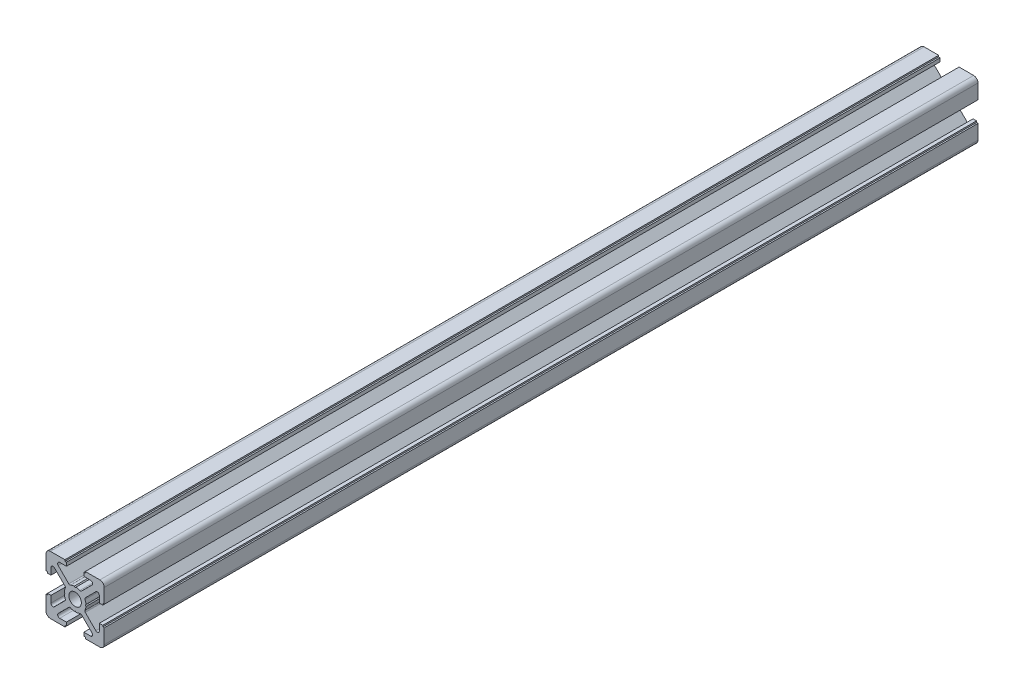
ISO-10303-21;
HEADER;
FILE_DESCRIPTION(('STEP AP214'),'2;1');
FILE_NAME('part.step','',(''),(''),'','','');
FILE_SCHEMA(('AUTOMOTIVE_DESIGN { 1 0 10303 214 1 1 1 1 }'));
ENDSEC;
DATA;
#1=APPLICATION_CONTEXT('core data for automotive mechanical design processes');
#2=APPLICATION_PROTOCOL_DEFINITION('international standard','automotive_design',2000,#1);
#3=PRODUCT_CONTEXT('',#1,'mechanical');
#4=PRODUCT('Part','Part','',(#3));
#5=PRODUCT_RELATED_PRODUCT_CATEGORY('part','',(#4));
#6=PRODUCT_DEFINITION_FORMATION('','',#4);
#7=PRODUCT_DEFINITION_CONTEXT('part definition',#1,'design');
#8=PRODUCT_DEFINITION('design','',#6,#7);
#9=PRODUCT_DEFINITION_SHAPE('','',#8);
#10=(LENGTH_UNIT() NAMED_UNIT(*) SI_UNIT(.MILLI.,.METRE.));
#11=(NAMED_UNIT(*) PLANE_ANGLE_UNIT() SI_UNIT($,.RADIAN.));
#12=(NAMED_UNIT(*) SI_UNIT($,.STERADIAN.) SOLID_ANGLE_UNIT());
#13=UNCERTAINTY_MEASURE_WITH_UNIT(LENGTH_MEASURE(1.E-05),#10,'distance_accuracy_value','');
#14=(GEOMETRIC_REPRESENTATION_CONTEXT(3) GLOBAL_UNCERTAINTY_ASSIGNED_CONTEXT((#13)) GLOBAL_UNIT_ASSIGNED_CONTEXT((#10,
#11,#12)) REPRESENTATION_CONTEXT('',''));
#15=CARTESIAN_POINT('',(0.,0.,0.));
#16=DIRECTION('',(0.,0.,1.));
#17=DIRECTION('',(1.,0.,0.));
#18=AXIS2_PLACEMENT_3D('',#15,#16,#17);
#19=CARTESIAN_POINT('',(-8.49999994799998,-10.,8.00000000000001));
#20=DIRECTION('',(0.,-1.,0.));
#21=DIRECTION('',(0.,0.,-1.));
#22=AXIS2_PLACEMENT_3D('',#19,#20,#21);
#23=PLANE('',#22);
#24=DIRECTION('',(1.,0.,0.));
#25=VECTOR('',#24,1.);
#26=CARTESIAN_POINT('',(-8.49999994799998,-10.,308.));
#27=LINE('',#26,#25);
#28=CARTESIAN_POINT('',(-8.49999994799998,-10.,308.));
#29=VERTEX_POINT('',#28);
#30=CARTESIAN_POINT('',(-3.49999994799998,-10.,308.));
#31=VERTEX_POINT('',#30);
#32=EDGE_CURVE('E588',#29,#31,#27,.T.);
#33=ORIENTED_EDGE('',*,*,#32,.F.);
#34=DIRECTION('',(0.,0.,1.));
#35=VECTOR('',#34,1.);
#36=CARTESIAN_POINT('',(-8.49999994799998,-10.,8.00000000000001));
#37=LINE('',#36,#35);
#38=CARTESIAN_POINT('',(-8.49999994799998,-10.,8.00000000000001));
#39=VERTEX_POINT('',#38);
#40=EDGE_CURVE('E11',#39,#29,#37,.T.);
#41=ORIENTED_EDGE('',*,*,#40,.F.);
#42=DIRECTION('',(1.,0.,0.));
#43=VECTOR('',#42,1.);
#44=CARTESIAN_POINT('',(-8.49999994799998,-10.,8.00000000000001));
#45=LINE('',#44,#43);
#46=CARTESIAN_POINT('',(-3.49999994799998,-10.,8.00000000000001));
#47=VERTEX_POINT('',#46);
#48=EDGE_CURVE('E837',#39,#47,#45,.T.);
#49=ORIENTED_EDGE('',*,*,#48,.T.);
#50=DIRECTION('',(0.,0.,1.));
#51=VECTOR('',#50,1.);
#52=CARTESIAN_POINT('',(-3.49999994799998,-10.,8.00000000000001));
#53=LINE('',#52,#51);
#54=EDGE_CURVE('E38',#47,#31,#53,.T.);
#55=ORIENTED_EDGE('',*,*,#54,.T.);
#56=EDGE_LOOP('',(#33,#41,#49,#55));
#57=FACE_BOUND('',#56,.T.);
#58=ADVANCED_FACE('F35',(#57),#23,.T.);
#59=CARTESIAN_POINT('',(-8.49999994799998,-8.5,8.00000000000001));
#60=DIRECTION('',(0.,0.,1.));
#61=DIRECTION('',(1.,0.,0.));
#62=AXIS2_PLACEMENT_3D('',#59,#60,#61);
#63=CYLINDRICAL_SURFACE('',#62,1.5);
#64=CARTESIAN_POINT('',(-8.49999994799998,-8.5,308.));
#65=DIRECTION('',(0.,0.,1.));
#66=DIRECTION('',(1.,0.,0.));
#67=AXIS2_PLACEMENT_3D('',#64,#65,#66);
#68=CIRCLE('',#67,1.5);
#69=CARTESIAN_POINT('',(-9.99999994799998,-8.5,308.));
#70=VERTEX_POINT('',#69);
#71=EDGE_CURVE('E835',#70,#29,#68,.T.);
#72=ORIENTED_EDGE('',*,*,#71,.F.);
#73=DIRECTION('',(0.,0.,1.));
#74=VECTOR('',#73,1.);
#75=CARTESIAN_POINT('',(-9.99999994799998,-8.5,8.00000000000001));
#76=LINE('',#75,#74);
#77=CARTESIAN_POINT('',(-9.99999994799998,-8.5,8.00000000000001));
#78=VERTEX_POINT('',#77);
#79=EDGE_CURVE('E44',#78,#70,#76,.T.);
#80=ORIENTED_EDGE('',*,*,#79,.F.);
#81=CARTESIAN_POINT('',(-8.49999994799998,-8.5,8.00000000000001));
#82=DIRECTION('',(0.,0.,1.));
#83=DIRECTION('',(1.,0.,0.));
#84=AXIS2_PLACEMENT_3D('',#81,#82,#83);
#85=CIRCLE('',#84,1.5);
#86=EDGE_CURVE('E578',#78,#39,#85,.T.);
#87=ORIENTED_EDGE('',*,*,#86,.T.);
#88=ORIENTED_EDGE('',*,*,#40,.T.);
#89=EDGE_LOOP('',(#72,#80,#87,#88));
#90=FACE_BOUND('',#89,.T.);
#91=ADVANCED_FACE('F1001',(#90),#63,.T.);
#92=CARTESIAN_POINT('',(-9.99999994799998,-3.5,8.00000000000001));
#93=DIRECTION('',(-1.,0.,0.));
#94=DIRECTION('',(0.,0.,1.));
#95=AXIS2_PLACEMENT_3D('',#92,#93,#94);
#96=PLANE('',#95);
#97=DIRECTION('',(0.,-1.,0.));
#98=VECTOR('',#97,1.);
#99=CARTESIAN_POINT('',(-9.99999994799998,-3.5,308.));
#100=LINE('',#99,#98);
#101=CARTESIAN_POINT('',(-9.99999994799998,-3.5,308.));
#102=VERTEX_POINT('',#101);
#103=EDGE_CURVE('E565',#102,#70,#100,.T.);
#104=ORIENTED_EDGE('',*,*,#103,.F.);
#105=DIRECTION('',(0.,0.,1.));
#106=VECTOR('',#105,1.);
#107=CARTESIAN_POINT('',(-9.99999994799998,-3.5,8.00000000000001));
#108=LINE('',#107,#106);
#109=CARTESIAN_POINT('',(-9.99999994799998,-3.5,8.00000000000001));
#110=VERTEX_POINT('',#109);
#111=EDGE_CURVE('E560',#110,#102,#108,.T.);
#112=ORIENTED_EDGE('',*,*,#111,.F.);
#113=DIRECTION('',(0.,-1.,0.));
#114=VECTOR('',#113,1.);
#115=CARTESIAN_POINT('',(-9.99999994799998,-3.5,8.00000000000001));
#116=LINE('',#115,#114);
#117=EDGE_CURVE('E563',#110,#78,#116,.T.);
#118=ORIENTED_EDGE('',*,*,#117,.T.);
#119=ORIENTED_EDGE('',*,*,#79,.T.);
#120=EDGE_LOOP('',(#104,#112,#118,#119));
#121=FACE_BOUND('',#120,.T.);
#122=ADVANCED_FACE('F562',(#121),#96,.T.);
#123=CARTESIAN_POINT('',(-9.49999994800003,-3.5,8.00000000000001));
#124=DIRECTION('',(0.,1.,0.));
#125=DIRECTION('',(0.,0.,1.));
#126=AXIS2_PLACEMENT_3D('',#123,#124,#125);
#127=PLANE('',#126);
#128=DIRECTION('',(-1.,0.,0.));
#129=VECTOR('',#128,1.);
#130=CARTESIAN_POINT('',(-9.49999994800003,-3.5,308.));
#131=LINE('',#130,#129);
#132=CARTESIAN_POINT('',(-9.49999994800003,-3.5,308.));
#133=VERTEX_POINT('',#132);
#134=EDGE_CURVE('E832',#133,#102,#131,.T.);
#135=ORIENTED_EDGE('',*,*,#134,.F.);
#136=DIRECTION('',(0.,0.,1.));
#137=VECTOR('',#136,1.);
#138=CARTESIAN_POINT('',(-9.49999994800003,-3.5,8.00000000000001));
#139=LINE('',#138,#137);
#140=CARTESIAN_POINT('',(-9.49999994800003,-3.5,8.00000000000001));
#141=VERTEX_POINT('',#140);
#142=EDGE_CURVE('E570',#141,#133,#139,.T.);
#143=ORIENTED_EDGE('',*,*,#142,.F.);
#144=DIRECTION('',(-1.,0.,0.));
#145=VECTOR('',#144,1.);
#146=CARTESIAN_POINT('',(-9.49999994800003,-3.5,8.00000000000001));
#147=LINE('',#146,#145);
#148=EDGE_CURVE('E576',#141,#110,#147,.T.);
#149=ORIENTED_EDGE('',*,*,#148,.T.);
#150=ORIENTED_EDGE('',*,*,#111,.T.);
#151=EDGE_LOOP('',(#135,#143,#149,#150));
#152=FACE_BOUND('',#151,.T.);
#153=ADVANCED_FACE('F580',(#152),#127,.T.);
#154=CARTESIAN_POINT('',(-9.49999994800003,-3.,8.00000000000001));
#155=DIRECTION('',(-1.,0.,0.));
#156=DIRECTION('',(0.,0.,1.));
#157=AXIS2_PLACEMENT_3D('',#154,#155,#156);
#158=PLANE('',#157);
#159=DIRECTION('',(0.,-1.,0.));
#160=VECTOR('',#159,1.);
#161=CARTESIAN_POINT('',(-9.49999994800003,-3.,308.));
#162=LINE('',#161,#160);
#163=CARTESIAN_POINT('',(-9.49999994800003,-3.,308.));
#164=VERTEX_POINT('',#163);
#165=EDGE_CURVE('E829',#164,#133,#162,.T.);
#166=ORIENTED_EDGE('',*,*,#165,.F.);
#167=DIRECTION('',(0.,0.,1.));
#168=VECTOR('',#167,1.);
#169=CARTESIAN_POINT('',(-9.49999994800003,-3.,8.00000000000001));
#170=LINE('',#169,#168);
#171=CARTESIAN_POINT('',(-9.49999994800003,-3.,8.00000000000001));
#172=VERTEX_POINT('',#171);
#173=EDGE_CURVE('E841',#172,#164,#170,.T.);
#174=ORIENTED_EDGE('',*,*,#173,.F.);
#175=DIRECTION('',(0.,-1.,0.));
#176=VECTOR('',#175,1.);
#177=CARTESIAN_POINT('',(-9.49999994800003,-3.,8.00000000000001));
#178=LINE('',#177,#176);
#179=EDGE_CURVE('E581',#172,#141,#178,.T.);
#180=ORIENTED_EDGE('',*,*,#179,.T.);
#181=ORIENTED_EDGE('',*,*,#142,.T.);
#182=EDGE_LOOP('',(#166,#174,#180,#181));
#183=FACE_BOUND('',#182,.T.);
#184=ADVANCED_FACE('F1014',(#183),#158,.T.);
#185=CARTESIAN_POINT('',(-8.29999993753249,-3.,8.00000000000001));
#186=DIRECTION('',(0.,1.,0.));
#187=DIRECTION('',(-1.,0.,0.));
#188=AXIS2_PLACEMENT_3D('',#185,#186,#187);
#189=PLANE('',#188);
#190=DIRECTION('',(-1.,0.,0.));
#191=VECTOR('',#190,1.);
#192=CARTESIAN_POINT('',(-8.29999993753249,-3.,308.));
#193=LINE('',#192,#191);
#194=CARTESIAN_POINT('',(-8.29999993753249,-3.,308.));
#195=VERTEX_POINT('',#194);
#196=EDGE_CURVE('E826',#195,#164,#193,.T.);
#197=ORIENTED_EDGE('',*,*,#196,.F.);
#198=DIRECTION('',(0.,0.,1.));
#199=VECTOR('',#198,1.);
#200=CARTESIAN_POINT('',(-8.29999993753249,-3.,8.00000000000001));
#201=LINE('',#200,#199);
#202=CARTESIAN_POINT('',(-8.29999993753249,-3.,8.00000000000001));
#203=VERTEX_POINT('',#202);
#204=EDGE_CURVE('E843',#203,#195,#201,.T.);
#205=ORIENTED_EDGE('',*,*,#204,.F.);
#206=DIRECTION('',(-1.,0.,0.));
#207=VECTOR('',#206,1.);
#208=CARTESIAN_POINT('',(-8.29999993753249,-3.,8.00000000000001));
#209=LINE('',#208,#207);
#210=EDGE_CURVE('E583',#203,#172,#209,.T.);
#211=ORIENTED_EDGE('',*,*,#210,.T.);
#212=ORIENTED_EDGE('',*,*,#173,.T.);
#213=EDGE_LOOP('',(#197,#205,#211,#212));
#214=FACE_BOUND('',#213,.T.);
#215=ADVANCED_FACE('F1017',(#214),#189,.T.);
#216=CARTESIAN_POINT('',(-8.29999993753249,-5.29939031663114,8.00000000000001));
#217=DIRECTION('',(1.,0.,0.));
#218=DIRECTION('',(0.,0.,-1.));
#219=AXIS2_PLACEMENT_3D('',#216,#217,#218);
#220=PLANE('',#219);
#221=DIRECTION('',(0.,1.,0.));
#222=VECTOR('',#221,1.);
#223=CARTESIAN_POINT('',(-8.29999993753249,-5.29939031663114,308.));
#224=LINE('',#223,#222);
#225=CARTESIAN_POINT('',(-8.29999993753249,-5.29939031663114,308.));
#226=VERTEX_POINT('',#225);
#227=EDGE_CURVE('E823',#226,#195,#224,.T.);
#228=ORIENTED_EDGE('',*,*,#227,.F.);
#229=DIRECTION('',(0.,0.,1.));
#230=VECTOR('',#229,1.);
#231=CARTESIAN_POINT('',(-8.29999993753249,-5.29939031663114,8.00000000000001));
#232=LINE('',#231,#230);
#233=CARTESIAN_POINT('',(-8.29999993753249,-5.29939031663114,8.00000000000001));
#234=VERTEX_POINT('',#233);
#235=EDGE_CURVE('E845',#234,#226,#232,.T.);
#236=ORIENTED_EDGE('',*,*,#235,.F.);
#237=DIRECTION('',(0.,1.,0.));
#238=VECTOR('',#237,1.);
#239=CARTESIAN_POINT('',(-8.29999993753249,-5.29939031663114,8.00000000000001));
#240=LINE('',#239,#238);
#241=EDGE_CURVE('E1584',#234,#203,#240,.T.);
#242=ORIENTED_EDGE('',*,*,#241,.T.);
#243=ORIENTED_EDGE('',*,*,#204,.T.);
#244=EDGE_LOOP('',(#228,#236,#242,#243));
#245=FACE_BOUND('',#244,.T.);
#246=ADVANCED_FACE('F1021',(#245),#220,.T.);
#247=CARTESIAN_POINT('',(-7.59999993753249,-5.29939031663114,8.00000000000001));
#248=DIRECTION('',(0.,0.,1.));
#249=DIRECTION('',(1.,0.,0.));
#250=AXIS2_PLACEMENT_3D('',#247,#248,#249);
#251=CYLINDRICAL_SURFACE('',#250,0.699999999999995);
#252=CARTESIAN_POINT('',(-7.59999993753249,-5.29939031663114,308.));
#253=DIRECTION('',(0.,0.,-1.));
#254=DIRECTION('',(-1.,0.,0.));
#255=AXIS2_PLACEMENT_3D('',#252,#253,#254);
#256=CIRCLE('',#255,0.699999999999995);
#257=CARTESIAN_POINT('',(-7.10502518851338,-5.79436506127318,308.));
#258=VERTEX_POINT('',#257);
#259=EDGE_CURVE('E820',#258,#226,#256,.T.);
#260=ORIENTED_EDGE('',*,*,#259,.F.);
#261=DIRECTION('',(0.,0.,1.));
#262=VECTOR('',#261,1.);
#263=CARTESIAN_POINT('',(-7.10502518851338,-5.79436506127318,8.00000000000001));
#264=LINE('',#263,#262);
#265=CARTESIAN_POINT('',(-7.10502518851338,-5.79436506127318,8.00000000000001));
#266=VERTEX_POINT('',#265);
#267=EDGE_CURVE('E847',#266,#258,#264,.T.);
#268=ORIENTED_EDGE('',*,*,#267,.F.);
#269=CARTESIAN_POINT('',(-7.59999993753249,-5.29939031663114,8.00000000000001));
#270=DIRECTION('',(0.,0.,-1.));
#271=DIRECTION('',(-1.,0.,0.));
#272=AXIS2_PLACEMENT_3D('',#269,#270,#271);
#273=CIRCLE('',#272,0.699999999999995);
#274=EDGE_CURVE('E1581',#266,#234,#273,.T.);
#275=ORIENTED_EDGE('',*,*,#274,.T.);
#276=ORIENTED_EDGE('',*,*,#235,.T.);
#277=EDGE_LOOP('',(#260,#268,#275,#276));
#278=FACE_BOUND('',#277,.T.);
#279=ADVANCED_FACE('F1025',(#278),#251,.F.);
#280=CARTESIAN_POINT('',(-3.48612572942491,-2.1754655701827,8.00000000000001));
#281=DIRECTION('',(-0.707106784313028,0.707106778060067,0.));
#282=DIRECTION('',(-0.707106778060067,-0.707106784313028,0.));
#283=AXIS2_PLACEMENT_3D('',#280,#281,#282);
#284=PLANE('',#283);
#285=DIRECTION('',(-0.707106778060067,-0.707106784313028,0.));
#286=VECTOR('',#285,1.);
#287=CARTESIAN_POINT('',(-3.48612572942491,-2.1754655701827,308.));
#288=LINE('',#287,#286);
#289=CARTESIAN_POINT('',(-3.48612572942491,-2.1754655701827,308.));
#290=VERTEX_POINT('',#289);
#291=EDGE_CURVE('E817',#290,#258,#288,.T.);
#292=ORIENTED_EDGE('',*,*,#291,.F.);
#293=DIRECTION('',(0.,0.,1.));
#294=VECTOR('',#293,1.);
#295=CARTESIAN_POINT('',(-3.48612572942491,-2.1754655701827,8.00000000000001));
#296=LINE('',#295,#294);
#297=CARTESIAN_POINT('',(-3.48612572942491,-2.1754655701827,8.00000000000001));
#298=VERTEX_POINT('',#297);
#299=EDGE_CURVE('E849',#298,#290,#296,.T.);
#300=ORIENTED_EDGE('',*,*,#299,.F.);
#301=DIRECTION('',(-0.707106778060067,-0.707106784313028,0.));
#302=VECTOR('',#301,1.);
#303=CARTESIAN_POINT('',(-3.48612572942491,-2.1754655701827,8.00000000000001));
#304=LINE('',#303,#302);
#305=EDGE_CURVE('E1578',#298,#266,#304,.T.);
#306=ORIENTED_EDGE('',*,*,#305,.T.);
#307=ORIENTED_EDGE('',*,*,#267,.T.);
#308=EDGE_LOOP('',(#292,#300,#306,#307));
#309=FACE_BOUND('',#308,.T.);
#310=ADVANCED_FACE('F1029',(#309),#284,.T.);
#311=CARTESIAN_POINT('',(-3.83967912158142,-1.82191218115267,8.00000000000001));
#312=DIRECTION('',(0.,0.,1.));
#313=DIRECTION('',(1.,0.,0.));
#314=AXIS2_PLACEMENT_3D('',#311,#312,#313);
#315=CYLINDRICAL_SURFACE('',#314,0.499999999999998);
#316=CARTESIAN_POINT('',(-3.83967912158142,-1.82191218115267,308.));
#317=DIRECTION('',(0.,0.,-1.));
#318=DIRECTION('',(-1.,0.,0.));
#319=AXIS2_PLACEMENT_3D('',#316,#317,#318);
#320=CIRCLE('',#319,0.499999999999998);
#321=CARTESIAN_POINT('',(-3.38795216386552,-1.60756956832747,308.));
#322=VERTEX_POINT('',#321);
#323=EDGE_CURVE('E814',#322,#290,#320,.T.);
#324=ORIENTED_EDGE('',*,*,#323,.F.);
#325=DIRECTION('',(0.,0.,1.));
#326=VECTOR('',#325,1.);
#327=CARTESIAN_POINT('',(-3.38795216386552,-1.60756956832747,8.00000000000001));
#328=LINE('',#327,#326);
#329=CARTESIAN_POINT('',(-3.38795216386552,-1.60756956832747,8.00000000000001));
#330=VERTEX_POINT('',#329);
#331=EDGE_CURVE('E851',#330,#322,#328,.T.);
#332=ORIENTED_EDGE('',*,*,#331,.F.);
#333=CARTESIAN_POINT('',(-3.83967912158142,-1.82191218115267,8.00000000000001));
#334=DIRECTION('',(0.,0.,-1.));
#335=DIRECTION('',(-1.,0.,0.));
#336=AXIS2_PLACEMENT_3D('',#333,#334,#335);
#337=CIRCLE('',#336,0.499999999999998);
#338=EDGE_CURVE('E1575',#330,#298,#337,.T.);
#339=ORIENTED_EDGE('',*,*,#338,.T.);
#340=ORIENTED_EDGE('',*,*,#299,.T.);
#341=EDGE_LOOP('',(#324,#332,#339,#340));
#342=FACE_BOUND('',#341,.T.);
#343=ADVANCED_FACE('F1033',(#342),#315,.F.);
#344=CARTESIAN_POINT('',(1.91247788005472E-08,2.79189804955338E-08,8.00000000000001));
#345=DIRECTION('',(0.,0.,1.));
#346=DIRECTION('',(1.,0.,0.));
#347=AXIS2_PLACEMENT_3D('',#344,#345,#346);
#348=CYLINDRICAL_SURFACE('',#347,3.75000000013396);
#349=CARTESIAN_POINT('',(1.91247788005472E-08,2.79189804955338E-08,308.));
#350=DIRECTION('',(0.,0.,1.));
#351=DIRECTION('',(1.,0.,0.));
#352=AXIS2_PLACEMENT_3D('',#349,#350,#351);
#353=CIRCLE('',#352,3.75000000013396);
#354=CARTESIAN_POINT('',(-3.73798071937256,-0.299999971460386,308.));
#355=VERTEX_POINT('',#354);
#356=EDGE_CURVE('E811',#355,#322,#353,.T.);
#357=ORIENTED_EDGE('',*,*,#356,.F.);
#358=DIRECTION('',(0.,0.,1.));
#359=VECTOR('',#358,1.);
#360=CARTESIAN_POINT('',(-3.73798071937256,-0.299999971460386,8.00000000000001));
#361=LINE('',#360,#359);
#362=CARTESIAN_POINT('',(-3.73798071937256,-0.299999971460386,8.00000000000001));
#363=VERTEX_POINT('',#362);
#364=EDGE_CURVE('E853',#363,#355,#361,.T.);
#365=ORIENTED_EDGE('',*,*,#364,.F.);
#366=CARTESIAN_POINT('',(1.91247788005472E-08,2.79189804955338E-08,8.00000000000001));
#367=DIRECTION('',(0.,0.,1.));
#368=DIRECTION('',(1.,0.,0.));
#369=AXIS2_PLACEMENT_3D('',#366,#367,#368);
#370=CIRCLE('',#369,3.75000000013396);
#371=EDGE_CURVE('E1572',#363,#330,#370,.T.);
#372=ORIENTED_EDGE('',*,*,#371,.T.);
#373=ORIENTED_EDGE('',*,*,#331,.T.);
#374=EDGE_LOOP('',(#357,#365,#372,#373));
#375=FACE_BOUND('',#374,.T.);
#376=ADVANCED_FACE('F1037',(#375),#348,.T.);
#377=CARTESIAN_POINT('',(-3.44999998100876,2.79296942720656E-08,8.00000000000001));
#378=DIRECTION('',(-0.721410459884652,0.692507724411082,0.));
#379=DIRECTION('',(-0.692507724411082,-0.721410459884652,0.));
#380=AXIS2_PLACEMENT_3D('',#377,#378,#379);
#381=PLANE('',#380);
#382=DIRECTION('',(-0.692507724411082,-0.721410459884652,0.));
#383=VECTOR('',#382,1.);
#384=CARTESIAN_POINT('',(-3.44999998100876,2.79296942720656E-08,308.));
#385=LINE('',#384,#383);
#386=CARTESIAN_POINT('',(-3.44999998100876,2.79296942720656E-08,308.));
#387=VERTEX_POINT('',#386);
#388=EDGE_CURVE('E808',#387,#355,#385,.T.);
#389=ORIENTED_EDGE('',*,*,#388,.F.);
#390=DIRECTION('',(0.,0.,1.));
#391=VECTOR('',#390,1.);
#392=CARTESIAN_POINT('',(-3.44999998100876,2.79296942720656E-08,8.00000000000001));
#393=LINE('',#392,#391);
#394=CARTESIAN_POINT('',(-3.44999998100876,2.79296942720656E-08,8.00000000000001));
#395=VERTEX_POINT('',#394);
#396=EDGE_CURVE('E855',#395,#387,#393,.T.);
#397=ORIENTED_EDGE('',*,*,#396,.F.);
#398=DIRECTION('',(-0.692507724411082,-0.721410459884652,0.));
#399=VECTOR('',#398,1.);
#400=CARTESIAN_POINT('',(-3.44999998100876,2.79296942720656E-08,8.00000000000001));
#401=LINE('',#400,#399);
#402=EDGE_CURVE('E1569',#395,#363,#401,.T.);
#403=ORIENTED_EDGE('',*,*,#402,.T.);
#404=ORIENTED_EDGE('',*,*,#364,.T.);
#405=EDGE_LOOP('',(#389,#397,#403,#404));
#406=FACE_BOUND('',#405,.T.);
#407=ADVANCED_FACE('F1041',(#406),#381,.T.);
#408=CARTESIAN_POINT('',(-3.73798071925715,0.300000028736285,8.00000000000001));
#409=DIRECTION('',(-0.721410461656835,-0.692507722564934,0.));
#410=DIRECTION('',(0.692507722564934,-0.721410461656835,0.));
#411=AXIS2_PLACEMENT_3D('',#408,#409,#410);
#412=PLANE('',#411);
#413=DIRECTION('',(0.692507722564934,-0.721410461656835,0.));
#414=VECTOR('',#413,1.);
#415=CARTESIAN_POINT('',(-3.73798071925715,0.300000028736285,308.));
#416=LINE('',#415,#414);
#417=CARTESIAN_POINT('',(-3.73798071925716,0.300000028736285,308.));
#418=VERTEX_POINT('',#417);
#419=EDGE_CURVE('E805',#418,#387,#416,.T.);
#420=ORIENTED_EDGE('',*,*,#419,.F.);
#421=DIRECTION('',(0.,0.,1.));
#422=VECTOR('',#421,1.);
#423=CARTESIAN_POINT('',(-3.73798071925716,0.300000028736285,8.00000000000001));
#424=LINE('',#423,#422);
#425=CARTESIAN_POINT('',(-3.73798071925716,0.300000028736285,8.00000000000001));
#426=VERTEX_POINT('',#425);
#427=EDGE_CURVE('E857',#426,#418,#424,.T.);
#428=ORIENTED_EDGE('',*,*,#427,.F.);
#429=DIRECTION('',(0.692507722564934,-0.721410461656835,0.));
#430=VECTOR('',#429,1.);
#431=CARTESIAN_POINT('',(-3.73798071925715,0.300000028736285,8.00000000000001));
#432=LINE('',#431,#430);
#433=EDGE_CURVE('E1566',#426,#395,#432,.T.);
#434=ORIENTED_EDGE('',*,*,#433,.T.);
#435=ORIENTED_EDGE('',*,*,#396,.T.);
#436=EDGE_LOOP('',(#420,#428,#434,#435));
#437=FACE_BOUND('',#436,.T.);
#438=ADVANCED_FACE('F1045',(#437),#412,.T.);
#439=CARTESIAN_POINT('',(1.91247788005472E-08,2.79189804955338E-08,8.00000000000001));
#440=DIRECTION('',(0.,0.,1.));
#441=DIRECTION('',(1.,0.,0.));
#442=AXIS2_PLACEMENT_3D('',#439,#440,#441);
#443=CYLINDRICAL_SURFACE('',#442,3.75000000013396);
#444=CARTESIAN_POINT('',(1.91247788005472E-08,2.79189804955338E-08,308.));
#445=DIRECTION('',(0.,0.,1.));
#446=DIRECTION('',(1.,0.,0.));
#447=AXIS2_PLACEMENT_3D('',#444,#445,#446);
#448=CIRCLE('',#447,3.75000000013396);
#449=CARTESIAN_POINT('',(-3.38795217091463,1.60756960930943,308.));
#450=VERTEX_POINT('',#449);
#451=EDGE_CURVE('E802',#450,#418,#448,.T.);
#452=ORIENTED_EDGE('',*,*,#451,.F.);
#453=DIRECTION('',(0.,0.,1.));
#454=VECTOR('',#453,1.);
#455=CARTESIAN_POINT('',(-3.38795217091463,1.60756960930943,8.00000000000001));
#456=LINE('',#455,#454);
#457=CARTESIAN_POINT('',(-3.38795217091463,1.60756960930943,8.00000000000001));
#458=VERTEX_POINT('',#457);
#459=EDGE_CURVE('E859',#458,#450,#456,.T.);
#460=ORIENTED_EDGE('',*,*,#459,.F.);
#461=CARTESIAN_POINT('',(1.91247788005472E-08,2.79189804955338E-08,8.00000000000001));
#462=DIRECTION('',(0.,0.,1.));
#463=DIRECTION('',(1.,0.,0.));
#464=AXIS2_PLACEMENT_3D('',#461,#462,#463);
#465=CIRCLE('',#464,3.75000000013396);
#466=EDGE_CURVE('E1563',#458,#426,#465,.T.);
#467=ORIENTED_EDGE('',*,*,#466,.T.);
#468=ORIENTED_EDGE('',*,*,#427,.T.);
#469=EDGE_LOOP('',(#452,#460,#467,#468));
#470=FACE_BOUND('',#469,.T.);
#471=ADVANCED_FACE('F1049',(#470),#443,.T.);
#472=CARTESIAN_POINT('',(-3.83967912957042,1.82191222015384,8.00000000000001));
#473=DIRECTION('',(0.,0.,1.));
#474=DIRECTION('',(1.,0.,0.));
#475=AXIS2_PLACEMENT_3D('',#472,#473,#474);
#476=CYLINDRICAL_SURFACE('',#475,0.5);
#477=CARTESIAN_POINT('',(-3.83967912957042,1.82191222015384,308.));
#478=DIRECTION('',(0.,0.,-1.));
#479=DIRECTION('',(-1.,0.,0.));
#480=AXIS2_PLACEMENT_3D('',#477,#478,#479);
#481=CIRCLE('',#480,0.5);
#482=CARTESIAN_POINT('',(-3.48612573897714,2.17546561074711,308.));
#483=VERTEX_POINT('',#482);
#484=EDGE_CURVE('E799',#483,#450,#481,.T.);
#485=ORIENTED_EDGE('',*,*,#484,.F.);
#486=DIRECTION('',(0.,0.,1.));
#487=VECTOR('',#486,1.);
#488=CARTESIAN_POINT('',(-3.48612573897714,2.17546561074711,8.00000000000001));
#489=LINE('',#488,#487);
#490=CARTESIAN_POINT('',(-3.48612573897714,2.17546561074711,8.00000000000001));
#491=VERTEX_POINT('',#490);
#492=EDGE_CURVE('E861',#491,#483,#489,.T.);
#493=ORIENTED_EDGE('',*,*,#492,.F.);
#494=CARTESIAN_POINT('',(-3.83967912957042,1.82191222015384,8.00000000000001));
#495=DIRECTION('',(0.,0.,-1.));
#496=DIRECTION('',(-1.,0.,0.));
#497=AXIS2_PLACEMENT_3D('',#494,#495,#496);
#498=CIRCLE('',#497,0.5);
#499=EDGE_CURVE('E1560',#491,#458,#498,.T.);
#500=ORIENTED_EDGE('',*,*,#499,.T.);
#501=ORIENTED_EDGE('',*,*,#459,.T.);
#502=EDGE_LOOP('',(#485,#493,#500,#501));
#503=FACE_BOUND('',#502,.T.);
#504=ADVANCED_FACE('F1053',(#503),#476,.F.);
#505=CARTESIAN_POINT('',(-7.10502520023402,5.79436507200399,8.00000000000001));
#506=DIRECTION('',(-0.707106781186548,-0.707106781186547,0.));
#507=DIRECTION('',(0.707106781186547,-0.707106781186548,0.));
#508=AXIS2_PLACEMENT_3D('',#505,#506,#507);
#509=PLANE('',#508);
#510=DIRECTION('',(0.707106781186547,-0.707106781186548,0.));
#511=VECTOR('',#510,1.);
#512=CARTESIAN_POINT('',(-7.10502520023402,5.79436507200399,308.));
#513=LINE('',#512,#511);
#514=CARTESIAN_POINT('',(-7.10502520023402,5.79436507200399,308.));
#515=VERTEX_POINT('',#514);
#516=EDGE_CURVE('E796',#515,#483,#513,.T.);
#517=ORIENTED_EDGE('',*,*,#516,.F.);
#518=DIRECTION('',(0.,0.,1.));
#519=VECTOR('',#518,1.);
#520=CARTESIAN_POINT('',(-7.10502520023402,5.79436507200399,8.00000000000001));
#521=LINE('',#520,#519);
#522=CARTESIAN_POINT('',(-7.10502520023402,5.79436507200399,8.00000000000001));
#523=VERTEX_POINT('',#522);
#524=EDGE_CURVE('E863',#523,#515,#521,.T.);
#525=ORIENTED_EDGE('',*,*,#524,.F.);
#526=DIRECTION('',(0.707106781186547,-0.707106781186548,0.));
#527=VECTOR('',#526,1.);
#528=CARTESIAN_POINT('',(-7.10502520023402,5.79436507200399,8.00000000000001));
#529=LINE('',#528,#527);
#530=EDGE_CURVE('E1557',#523,#491,#529,.T.);
#531=ORIENTED_EDGE('',*,*,#530,.T.);
#532=ORIENTED_EDGE('',*,*,#492,.T.);
#533=EDGE_LOOP('',(#517,#525,#531,#532));
#534=FACE_BOUND('',#533,.T.);
#535=ADVANCED_FACE('F1057',(#534),#509,.T.);
#536=CARTESIAN_POINT('',(-7.59999994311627,5.29939032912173,8.00000000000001));
#537=DIRECTION('',(0.,0.,1.));
#538=DIRECTION('',(1.,0.,0.));
#539=AXIS2_PLACEMENT_3D('',#536,#537,#538);
#540=CYLINDRICAL_SURFACE('',#539,0.699999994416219);
#541=CARTESIAN_POINT('',(-7.59999994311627,5.29939032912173,308.));
#542=DIRECTION('',(0.,0.,-1.));
#543=DIRECTION('',(-1.,0.,0.));
#544=AXIS2_PLACEMENT_3D('',#541,#542,#543);
#545=CIRCLE('',#544,0.699999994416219);
#546=CARTESIAN_POINT('',(-8.29999993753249,5.29939032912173,308.));
#547=VERTEX_POINT('',#546);
#548=EDGE_CURVE('E793',#547,#515,#545,.T.);
#549=ORIENTED_EDGE('',*,*,#548,.F.);
#550=DIRECTION('',(0.,0.,1.));
#551=VECTOR('',#550,1.);
#552=CARTESIAN_POINT('',(-8.29999993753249,5.29939032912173,8.00000000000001));
#553=LINE('',#552,#551);
#554=CARTESIAN_POINT('',(-8.29999993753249,5.29939032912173,8.00000000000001));
#555=VERTEX_POINT('',#554);
#556=EDGE_CURVE('E865',#555,#547,#553,.T.);
#557=ORIENTED_EDGE('',*,*,#556,.F.);
#558=CARTESIAN_POINT('',(-7.59999994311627,5.29939032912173,8.00000000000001));
#559=DIRECTION('',(0.,0.,-1.));
#560=DIRECTION('',(-1.,0.,0.));
#561=AXIS2_PLACEMENT_3D('',#558,#559,#560);
#562=CIRCLE('',#561,0.699999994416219);
#563=EDGE_CURVE('E1554',#555,#523,#562,.T.);
#564=ORIENTED_EDGE('',*,*,#563,.T.);
#565=ORIENTED_EDGE('',*,*,#524,.T.);
#566=EDGE_LOOP('',(#549,#557,#564,#565));
#567=FACE_BOUND('',#566,.T.);
#568=ADVANCED_FACE('F1061',(#567),#540,.F.);
#569=CARTESIAN_POINT('',(-8.29999993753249,3.,8.00000000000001));
#570=DIRECTION('',(1.,0.,0.));
#571=DIRECTION('',(0.,0.,-1.));
#572=AXIS2_PLACEMENT_3D('',#569,#570,#571);
#573=PLANE('',#572);
#574=DIRECTION('',(0.,1.,0.));
#575=VECTOR('',#574,1.);
#576=CARTESIAN_POINT('',(-8.29999993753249,3.,308.));
#577=LINE('',#576,#575);
#578=CARTESIAN_POINT('',(-8.29999993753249,3.,308.));
#579=VERTEX_POINT('',#578);
#580=EDGE_CURVE('E790',#579,#547,#577,.T.);
#581=ORIENTED_EDGE('',*,*,#580,.F.);
#582=DIRECTION('',(0.,0.,1.));
#583=VECTOR('',#582,1.);
#584=CARTESIAN_POINT('',(-8.29999993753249,3.,8.00000000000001));
#585=LINE('',#584,#583);
#586=CARTESIAN_POINT('',(-8.29999993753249,3.,8.00000000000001));
#587=VERTEX_POINT('',#586);
#588=EDGE_CURVE('E867',#587,#579,#585,.T.);
#589=ORIENTED_EDGE('',*,*,#588,.F.);
#590=DIRECTION('',(0.,1.,0.));
#591=VECTOR('',#590,1.);
#592=CARTESIAN_POINT('',(-8.29999993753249,3.,8.00000000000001));
#593=LINE('',#592,#591);
#594=EDGE_CURVE('E1551',#587,#555,#593,.T.);
#595=ORIENTED_EDGE('',*,*,#594,.T.);
#596=ORIENTED_EDGE('',*,*,#556,.T.);
#597=EDGE_LOOP('',(#581,#589,#595,#596));
#598=FACE_BOUND('',#597,.T.);
#599=ADVANCED_FACE('F1065',(#598),#573,.T.);
#600=CARTESIAN_POINT('',(-9.49999994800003,3.,8.00000000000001));
#601=DIRECTION('',(0.,-1.,0.));
#602=DIRECTION('',(0.,0.,-1.));
#603=AXIS2_PLACEMENT_3D('',#600,#601,#602);
#604=PLANE('',#603);
#605=DIRECTION('',(1.,0.,0.));
#606=VECTOR('',#605,1.);
#607=CARTESIAN_POINT('',(-9.49999994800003,3.,308.));
#608=LINE('',#607,#606);
#609=CARTESIAN_POINT('',(-9.49999994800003,3.,308.));
#610=VERTEX_POINT('',#609);
#611=EDGE_CURVE('E787',#610,#579,#608,.T.);
#612=ORIENTED_EDGE('',*,*,#611,.F.);
#613=DIRECTION('',(0.,0.,1.));
#614=VECTOR('',#613,1.);
#615=CARTESIAN_POINT('',(-9.49999994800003,3.,8.00000000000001));
#616=LINE('',#615,#614);
#617=CARTESIAN_POINT('',(-9.49999994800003,3.,8.00000000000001));
#618=VERTEX_POINT('',#617);
#619=EDGE_CURVE('E869',#618,#610,#616,.T.);
#620=ORIENTED_EDGE('',*,*,#619,.F.);
#621=DIRECTION('',(1.,0.,0.));
#622=VECTOR('',#621,1.);
#623=CARTESIAN_POINT('',(-9.49999994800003,3.,8.00000000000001));
#624=LINE('',#623,#622);
#625=EDGE_CURVE('E1548',#618,#587,#624,.T.);
#626=ORIENTED_EDGE('',*,*,#625,.T.);
#627=ORIENTED_EDGE('',*,*,#588,.T.);
#628=EDGE_LOOP('',(#612,#620,#626,#627));
#629=FACE_BOUND('',#628,.T.);
#630=ADVANCED_FACE('F1069',(#629),#604,.T.);
#631=CARTESIAN_POINT('',(-9.49999994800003,3.5,8.00000000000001));
#632=DIRECTION('',(-1.,0.,0.));
#633=DIRECTION('',(0.,0.,1.));
#634=AXIS2_PLACEMENT_3D('',#631,#632,#633);
#635=PLANE('',#634);
#636=DIRECTION('',(0.,-1.,0.));
#637=VECTOR('',#636,1.);
#638=CARTESIAN_POINT('',(-9.49999994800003,3.5,308.));
#639=LINE('',#638,#637);
#640=CARTESIAN_POINT('',(-9.49999994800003,3.5,308.));
#641=VERTEX_POINT('',#640);
#642=EDGE_CURVE('E784',#641,#610,#639,.T.);
#643=ORIENTED_EDGE('',*,*,#642,.F.);
#644=DIRECTION('',(0.,0.,1.));
#645=VECTOR('',#644,1.);
#646=CARTESIAN_POINT('',(-9.49999994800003,3.5,8.00000000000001));
#647=LINE('',#646,#645);
#648=CARTESIAN_POINT('',(-9.49999994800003,3.5,8.00000000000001));
#649=VERTEX_POINT('',#648);
#650=EDGE_CURVE('E871',#649,#641,#647,.T.);
#651=ORIENTED_EDGE('',*,*,#650,.F.);
#652=DIRECTION('',(0.,-1.,0.));
#653=VECTOR('',#652,1.);
#654=CARTESIAN_POINT('',(-9.49999994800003,3.5,8.00000000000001));
#655=LINE('',#654,#653);
#656=EDGE_CURVE('E1545',#649,#618,#655,.T.);
#657=ORIENTED_EDGE('',*,*,#656,.T.);
#658=ORIENTED_EDGE('',*,*,#619,.T.);
#659=EDGE_LOOP('',(#643,#651,#657,#658));
#660=FACE_BOUND('',#659,.T.);
#661=ADVANCED_FACE('F1073',(#660),#635,.T.);
#662=CARTESIAN_POINT('',(-9.99999994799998,3.5,8.00000000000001));
#663=DIRECTION('',(0.,-1.,0.));
#664=DIRECTION('',(0.,0.,-1.));
#665=AXIS2_PLACEMENT_3D('',#662,#663,#664);
#666=PLANE('',#665);
#667=DIRECTION('',(1.,0.,0.));
#668=VECTOR('',#667,1.);
#669=CARTESIAN_POINT('',(-9.99999994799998,3.5,308.));
#670=LINE('',#669,#668);
#671=CARTESIAN_POINT('',(-9.99999994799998,3.5,308.));
#672=VERTEX_POINT('',#671);
#673=EDGE_CURVE('E781',#672,#641,#670,.T.);
#674=ORIENTED_EDGE('',*,*,#673,.F.);
#675=DIRECTION('',(0.,0.,1.));
#676=VECTOR('',#675,1.);
#677=CARTESIAN_POINT('',(-9.99999994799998,3.5,8.00000000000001));
#678=LINE('',#677,#676);
#679=CARTESIAN_POINT('',(-9.99999994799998,3.5,8.00000000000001));
#680=VERTEX_POINT('',#679);
#681=EDGE_CURVE('E873',#680,#672,#678,.T.);
#682=ORIENTED_EDGE('',*,*,#681,.F.);
#683=DIRECTION('',(1.,0.,0.));
#684=VECTOR('',#683,1.);
#685=CARTESIAN_POINT('',(-9.99999994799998,3.5,8.00000000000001));
#686=LINE('',#685,#684);
#687=EDGE_CURVE('E1542',#680,#649,#686,.T.);
#688=ORIENTED_EDGE('',*,*,#687,.T.);
#689=ORIENTED_EDGE('',*,*,#650,.T.);
#690=EDGE_LOOP('',(#674,#682,#688,#689));
#691=FACE_BOUND('',#690,.T.);
#692=ADVANCED_FACE('F1077',(#691),#666,.T.);
#693=CARTESIAN_POINT('',(-9.99999994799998,8.5,8.00000000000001));
#694=DIRECTION('',(-1.,0.,0.));
#695=DIRECTION('',(0.,0.,1.));
#696=AXIS2_PLACEMENT_3D('',#693,#694,#695);
#697=PLANE('',#696);
#698=DIRECTION('',(0.,-1.,0.));
#699=VECTOR('',#698,1.);
#700=CARTESIAN_POINT('',(-9.99999994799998,8.5,308.));
#701=LINE('',#700,#699);
#702=CARTESIAN_POINT('',(-9.99999994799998,8.5,308.));
#703=VERTEX_POINT('',#702);
#704=EDGE_CURVE('E778',#703,#672,#701,.T.);
#705=ORIENTED_EDGE('',*,*,#704,.F.);
#706=DIRECTION('',(0.,0.,1.));
#707=VECTOR('',#706,1.);
#708=CARTESIAN_POINT('',(-9.99999994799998,8.5,8.00000000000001));
#709=LINE('',#708,#707);
#710=CARTESIAN_POINT('',(-9.99999994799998,8.5,8.00000000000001));
#711=VERTEX_POINT('',#710);
#712=EDGE_CURVE('E875',#711,#703,#709,.T.);
#713=ORIENTED_EDGE('',*,*,#712,.F.);
#714=DIRECTION('',(0.,-1.,0.));
#715=VECTOR('',#714,1.);
#716=CARTESIAN_POINT('',(-9.99999994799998,8.5,8.00000000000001));
#717=LINE('',#716,#715);
#718=EDGE_CURVE('E1539',#711,#680,#717,.T.);
#719=ORIENTED_EDGE('',*,*,#718,.T.);
#720=ORIENTED_EDGE('',*,*,#681,.T.);
#721=EDGE_LOOP('',(#705,#713,#719,#720));
#722=FACE_BOUND('',#721,.T.);
#723=ADVANCED_FACE('F1081',(#722),#697,.T.);
#724=CARTESIAN_POINT('',(-8.49999994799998,8.5,8.00000000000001));
#725=DIRECTION('',(0.,0.,1.));
#726=DIRECTION('',(1.,0.,0.));
#727=AXIS2_PLACEMENT_3D('',#724,#725,#726);
#728=CYLINDRICAL_SURFACE('',#727,1.5);
#729=CARTESIAN_POINT('',(-8.49999994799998,8.5,308.));
#730=DIRECTION('',(0.,0.,1.));
#731=DIRECTION('',(1.,0.,0.));
#732=AXIS2_PLACEMENT_3D('',#729,#730,#731);
#733=CIRCLE('',#732,1.5);
#734=CARTESIAN_POINT('',(-8.49999994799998,10.,308.));
#735=VERTEX_POINT('',#734);
#736=EDGE_CURVE('E775',#735,#703,#733,.T.);
#737=ORIENTED_EDGE('',*,*,#736,.F.);
#738=DIRECTION('',(0.,0.,1.));
#739=VECTOR('',#738,1.);
#740=CARTESIAN_POINT('',(-8.49999994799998,10.,8.00000000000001));
#741=LINE('',#740,#739);
#742=CARTESIAN_POINT('',(-8.49999994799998,10.,8.00000000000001));
#743=VERTEX_POINT('',#742);
#744=EDGE_CURVE('E877',#743,#735,#741,.T.);
#745=ORIENTED_EDGE('',*,*,#744,.F.);
#746=CARTESIAN_POINT('',(-8.49999994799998,8.5,8.00000000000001));
#747=DIRECTION('',(0.,0.,1.));
#748=DIRECTION('',(1.,0.,0.));
#749=AXIS2_PLACEMENT_3D('',#746,#747,#748);
#750=CIRCLE('',#749,1.5);
#751=EDGE_CURVE('E1536',#743,#711,#750,.T.);
#752=ORIENTED_EDGE('',*,*,#751,.T.);
#753=ORIENTED_EDGE('',*,*,#712,.T.);
#754=EDGE_LOOP('',(#737,#745,#752,#753));
#755=FACE_BOUND('',#754,.T.);
#756=ADVANCED_FACE('F1085',(#755),#728,.T.);
#757=CARTESIAN_POINT('',(-3.49999994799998,10.,8.00000000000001));
#758=DIRECTION('',(0.,1.,0.));
#759=DIRECTION('',(0.,0.,1.));
#760=AXIS2_PLACEMENT_3D('',#757,#758,#759);
#761=PLANE('',#760);
#762=DIRECTION('',(-1.,0.,0.));
#763=VECTOR('',#762,1.);
#764=CARTESIAN_POINT('',(-3.49999994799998,10.,308.));
#765=LINE('',#764,#763);
#766=CARTESIAN_POINT('',(-3.49999994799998,10.,308.));
#767=VERTEX_POINT('',#766);
#768=EDGE_CURVE('E772',#767,#735,#765,.T.);
#769=ORIENTED_EDGE('',*,*,#768,.F.);
#770=DIRECTION('',(0.,0.,1.));
#771=VECTOR('',#770,1.);
#772=CARTESIAN_POINT('',(-3.49999994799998,10.,8.00000000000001));
#773=LINE('',#772,#771);
#774=CARTESIAN_POINT('',(-3.49999994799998,10.,8.00000000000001));
#775=VERTEX_POINT('',#774);
#776=EDGE_CURVE('E879',#775,#767,#773,.T.);
#777=ORIENTED_EDGE('',*,*,#776,.F.);
#778=DIRECTION('',(-1.,0.,0.));
#779=VECTOR('',#778,1.);
#780=CARTESIAN_POINT('',(-3.49999994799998,10.,8.00000000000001));
#781=LINE('',#780,#779);
#782=EDGE_CURVE('E1533',#775,#743,#781,.T.);
#783=ORIENTED_EDGE('',*,*,#782,.T.);
#784=ORIENTED_EDGE('',*,*,#744,.T.);
#785=EDGE_LOOP('',(#769,#777,#783,#784));
#786=FACE_BOUND('',#785,.T.);
#787=ADVANCED_FACE('F1089',(#786),#761,.T.);
#788=CARTESIAN_POINT('',(-3.49999994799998,9.5,8.00000000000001));
#789=DIRECTION('',(1.,0.,0.));
#790=DIRECTION('',(0.,0.,-1.));
#791=AXIS2_PLACEMENT_3D('',#788,#789,#790);
#792=PLANE('',#791);
#793=DIRECTION('',(0.,1.,0.));
#794=VECTOR('',#793,1.);
#795=CARTESIAN_POINT('',(-3.49999994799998,9.5,308.));
#796=LINE('',#795,#794);
#797=CARTESIAN_POINT('',(-3.49999994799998,9.5,308.));
#798=VERTEX_POINT('',#797);
#799=EDGE_CURVE('E769',#798,#767,#796,.T.);
#800=ORIENTED_EDGE('',*,*,#799,.F.);
#801=DIRECTION('',(0.,0.,1.));
#802=VECTOR('',#801,1.);
#803=CARTESIAN_POINT('',(-3.49999994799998,9.5,8.00000000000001));
#804=LINE('',#803,#802);
#805=CARTESIAN_POINT('',(-3.49999994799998,9.5,8.00000000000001));
#806=VERTEX_POINT('',#805);
#807=EDGE_CURVE('E881',#806,#798,#804,.T.);
#808=ORIENTED_EDGE('',*,*,#807,.F.);
#809=DIRECTION('',(0.,1.,0.));
#810=VECTOR('',#809,1.);
#811=CARTESIAN_POINT('',(-3.49999994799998,9.5,8.00000000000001));
#812=LINE('',#811,#810);
#813=EDGE_CURVE('E1530',#806,#775,#812,.T.);
#814=ORIENTED_EDGE('',*,*,#813,.T.);
#815=ORIENTED_EDGE('',*,*,#776,.T.);
#816=EDGE_LOOP('',(#800,#808,#814,#815));
#817=FACE_BOUND('',#816,.T.);
#818=ADVANCED_FACE('F1093',(#817),#792,.T.);
#819=CARTESIAN_POINT('',(-2.99999994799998,9.5,8.00000000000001));
#820=DIRECTION('',(0.,1.,0.));
#821=DIRECTION('',(0.,0.,1.));
#822=AXIS2_PLACEMENT_3D('',#819,#820,#821);
#823=PLANE('',#822);
#824=DIRECTION('',(-1.,0.,0.));
#825=VECTOR('',#824,1.);
#826=CARTESIAN_POINT('',(-2.99999994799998,9.5,308.));
#827=LINE('',#826,#825);
#828=CARTESIAN_POINT('',(-2.99999994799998,9.5,308.));
#829=VERTEX_POINT('',#828);
#830=EDGE_CURVE('E766',#829,#798,#827,.T.);
#831=ORIENTED_EDGE('',*,*,#830,.F.);
#832=DIRECTION('',(0.,0.,1.));
#833=VECTOR('',#832,1.);
#834=CARTESIAN_POINT('',(-2.99999994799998,9.5,8.00000000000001));
#835=LINE('',#834,#833);
#836=CARTESIAN_POINT('',(-2.99999994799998,9.5,8.00000000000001));
#837=VERTEX_POINT('',#836);
#838=EDGE_CURVE('E883',#837,#829,#835,.T.);
#839=ORIENTED_EDGE('',*,*,#838,.F.);
#840=DIRECTION('',(-1.,0.,0.));
#841=VECTOR('',#840,1.);
#842=CARTESIAN_POINT('',(-2.99999994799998,9.5,8.00000000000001));
#843=LINE('',#842,#841);
#844=EDGE_CURVE('E1527',#837,#806,#843,.T.);
#845=ORIENTED_EDGE('',*,*,#844,.T.);
#846=ORIENTED_EDGE('',*,*,#807,.T.);
#847=EDGE_LOOP('',(#831,#839,#845,#846));
#848=FACE_BOUND('',#847,.T.);
#849=ADVANCED_FACE('F1097',(#848),#823,.T.);
#850=CARTESIAN_POINT('',(-2.99999994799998,8.30000002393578,8.00000000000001));
#851=DIRECTION('',(1.,0.,0.));
#852=DIRECTION('',(0.,0.,-1.));
#853=AXIS2_PLACEMENT_3D('',#850,#851,#852);
#854=PLANE('',#853);
#855=DIRECTION('',(0.,1.,0.));
#856=VECTOR('',#855,1.);
#857=CARTESIAN_POINT('',(-2.99999994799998,8.30000002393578,308.));
#858=LINE('',#857,#856);
#859=CARTESIAN_POINT('',(-2.99999994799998,8.30000002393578,308.));
#860=VERTEX_POINT('',#859);
#861=EDGE_CURVE('E763',#860,#829,#858,.T.);
#862=ORIENTED_EDGE('',*,*,#861,.F.);
#863=DIRECTION('',(0.,0.,1.));
#864=VECTOR('',#863,1.);
#865=CARTESIAN_POINT('',(-2.99999994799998,8.30000002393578,8.00000000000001));
#866=LINE('',#865,#864);
#867=CARTESIAN_POINT('',(-2.99999994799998,8.30000002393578,8.00000000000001));
#868=VERTEX_POINT('',#867);
#869=EDGE_CURVE('E885',#868,#860,#866,.T.);
#870=ORIENTED_EDGE('',*,*,#869,.F.);
#871=DIRECTION('',(0.,1.,0.));
#872=VECTOR('',#871,1.);
#873=CARTESIAN_POINT('',(-2.99999994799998,8.30000002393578,8.00000000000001));
#874=LINE('',#873,#872);
#875=EDGE_CURVE('E1524',#868,#837,#874,.T.);
#876=ORIENTED_EDGE('',*,*,#875,.T.);
#877=ORIENTED_EDGE('',*,*,#838,.T.);
#878=EDGE_LOOP('',(#862,#870,#876,#877));
#879=FACE_BOUND('',#878,.T.);
#880=ADVANCED_FACE('F1101',(#879),#854,.T.);
#881=CARTESIAN_POINT('',(-5.2993902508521,8.30000002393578,8.00000000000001));
#882=DIRECTION('',(0.,-1.,0.));
#883=DIRECTION('',(0.,0.,-1.));
#884=AXIS2_PLACEMENT_3D('',#881,#882,#883);
#885=PLANE('',#884);
#886=DIRECTION('',(1.,0.,0.));
#887=VECTOR('',#886,1.);
#888=CARTESIAN_POINT('',(-5.2993902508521,8.30000002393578,308.));
#889=LINE('',#888,#887);
#890=CARTESIAN_POINT('',(-5.2993902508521,8.30000002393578,308.));
#891=VERTEX_POINT('',#890);
#892=EDGE_CURVE('E760',#891,#860,#889,.T.);
#893=ORIENTED_EDGE('',*,*,#892,.F.);
#894=DIRECTION('',(0.,0.,1.));
#895=VECTOR('',#894,1.);
#896=CARTESIAN_POINT('',(-5.2993902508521,8.30000002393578,8.00000000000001));
#897=LINE('',#896,#895);
#898=CARTESIAN_POINT('',(-5.2993902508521,8.30000002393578,8.00000000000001));
#899=VERTEX_POINT('',#898);
#900=EDGE_CURVE('E887',#899,#891,#897,.T.);
#901=ORIENTED_EDGE('',*,*,#900,.F.);
#902=DIRECTION('',(1.,0.,0.));
#903=VECTOR('',#902,1.);
#904=CARTESIAN_POINT('',(-5.2993902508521,8.30000002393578,8.00000000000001));
#905=LINE('',#904,#903);
#906=EDGE_CURVE('E1521',#899,#868,#905,.T.);
#907=ORIENTED_EDGE('',*,*,#906,.T.);
#908=ORIENTED_EDGE('',*,*,#869,.T.);
#909=EDGE_LOOP('',(#893,#901,#907,#908));
#910=FACE_BOUND('',#909,.T.);
#911=ADVANCED_FACE('F1105',(#910),#885,.T.);
#912=CARTESIAN_POINT('',(-5.2993902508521,7.60000002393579,8.00000000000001));
#913=DIRECTION('',(0.,0.,1.));
#914=DIRECTION('',(1.,0.,0.));
#915=AXIS2_PLACEMENT_3D('',#912,#913,#914);
#916=CYLINDRICAL_SURFACE('',#915,0.699999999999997);
#917=CARTESIAN_POINT('',(-5.2993902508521,7.60000002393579,308.));
#918=DIRECTION('',(0.,0.,-1.));
#919=DIRECTION('',(-1.,0.,0.));
#920=AXIS2_PLACEMENT_3D('',#917,#918,#919);
#921=CIRCLE('',#920,0.699999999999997);
#922=CARTESIAN_POINT('',(-5.7943649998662,7.10502527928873,308.));
#923=VERTEX_POINT('',#922);
#924=EDGE_CURVE('E757',#923,#891,#921,.T.);
#925=ORIENTED_EDGE('',*,*,#924,.F.);
#926=DIRECTION('',(0.,0.,1.));
#927=VECTOR('',#926,1.);
#928=CARTESIAN_POINT('',(-5.7943649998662,7.10502527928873,8.00000000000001));
#929=LINE('',#928,#927);
#930=CARTESIAN_POINT('',(-5.7943649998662,7.10502527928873,8.00000000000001));
#931=VERTEX_POINT('',#930);
#932=EDGE_CURVE('E889',#931,#923,#929,.T.);
#933=ORIENTED_EDGE('',*,*,#932,.F.);
#934=CARTESIAN_POINT('',(-5.2993902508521,7.60000002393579,8.00000000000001));
#935=DIRECTION('',(0.,0.,-1.));
#936=DIRECTION('',(-1.,0.,0.));
#937=AXIS2_PLACEMENT_3D('',#934,#935,#936);
#938=CIRCLE('',#937,0.699999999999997);
#939=EDGE_CURVE('E1518',#931,#899,#938,.T.);
#940=ORIENTED_EDGE('',*,*,#939,.T.);
#941=ORIENTED_EDGE('',*,*,#900,.T.);
#942=EDGE_LOOP('',(#925,#933,#940,#941));
#943=FACE_BOUND('',#942,.T.);
#944=ADVANCED_FACE('F1109',(#943),#916,.F.);
#945=CARTESIAN_POINT('',(-2.17546554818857,3.48612579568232,8.00000000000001));
#946=DIRECTION('',(0.707106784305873,0.707106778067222,0.));
#947=DIRECTION('',(-0.707106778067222,0.707106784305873,0.));
#948=AXIS2_PLACEMENT_3D('',#945,#946,#947);
#949=PLANE('',#948);
#950=DIRECTION('',(-0.707106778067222,0.707106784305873,0.));
#951=VECTOR('',#950,1.);
#952=CARTESIAN_POINT('',(-2.17546554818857,3.48612579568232,308.));
#953=LINE('',#952,#951);
#954=CARTESIAN_POINT('',(-2.17546554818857,3.48612579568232,308.));
#955=VERTEX_POINT('',#954);
#956=EDGE_CURVE('E754',#955,#923,#953,.T.);
#957=ORIENTED_EDGE('',*,*,#956,.F.);
#958=DIRECTION('',(0.,0.,1.));
#959=VECTOR('',#958,1.);
#960=CARTESIAN_POINT('',(-2.17546554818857,3.48612579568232,8.00000000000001));
#961=LINE('',#960,#959);
#962=CARTESIAN_POINT('',(-2.17546554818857,3.48612579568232,8.00000000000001));
#963=VERTEX_POINT('',#962);
#964=EDGE_CURVE('E891',#963,#955,#961,.T.);
#965=ORIENTED_EDGE('',*,*,#964,.F.);
#966=DIRECTION('',(-0.707106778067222,0.707106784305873,0.));
#967=VECTOR('',#966,1.);
#968=CARTESIAN_POINT('',(-2.17546554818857,3.48612579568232,8.00000000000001));
#969=LINE('',#968,#967);
#970=EDGE_CURVE('E1515',#963,#931,#969,.T.);
#971=ORIENTED_EDGE('',*,*,#970,.T.);
#972=ORIENTED_EDGE('',*,*,#932,.T.);
#973=EDGE_LOOP('',(#957,#965,#971,#972));
#974=FACE_BOUND('',#973,.T.);
#975=ADVANCED_FACE('F1113',(#974),#949,.T.);
#976=CARTESIAN_POINT('',(-1.82191215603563,3.83967918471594,8.00000000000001));
#977=DIRECTION('',(0.,0.,1.));
#978=DIRECTION('',(1.,0.,0.));
#979=AXIS2_PLACEMENT_3D('',#976,#977,#978);
#980=CYLINDRICAL_SURFACE('',#979,0.500000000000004);
#981=CARTESIAN_POINT('',(-1.82191215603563,3.83967918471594,308.));
#982=DIRECTION('',(0.,0.,-1.));
#983=DIRECTION('',(-1.,0.,0.));
#984=AXIS2_PLACEMENT_3D('',#981,#982,#983);
#985=CIRCLE('',#984,0.500000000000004);
#986=CARTESIAN_POINT('',(-1.60756954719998,3.387952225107,308.));
#987=VERTEX_POINT('',#986);
#988=EDGE_CURVE('E751',#987,#955,#985,.T.);
#989=ORIENTED_EDGE('',*,*,#988,.F.);
#990=DIRECTION('',(0.,0.,1.));
#991=VECTOR('',#990,1.);
#992=CARTESIAN_POINT('',(-1.60756954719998,3.387952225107,8.00000000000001));
#993=LINE('',#992,#991);
#994=CARTESIAN_POINT('',(-1.60756954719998,3.387952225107,8.00000000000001));
#995=VERTEX_POINT('',#994);
#996=EDGE_CURVE('E893',#995,#987,#993,.T.);
#997=ORIENTED_EDGE('',*,*,#996,.F.);
#998=CARTESIAN_POINT('',(-1.82191215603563,3.83967918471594,8.00000000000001));
#999=DIRECTION('',(0.,0.,-1.));
#1000=DIRECTION('',(-1.,0.,0.));
#1001=AXIS2_PLACEMENT_3D('',#998,#999,#1000);
#1002=CIRCLE('',#1001,0.500000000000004);
#1003=EDGE_CURVE('E1512',#995,#963,#1002,.T.);
#1004=ORIENTED_EDGE('',*,*,#1003,.T.);
#1005=ORIENTED_EDGE('',*,*,#964,.T.);
#1006=EDGE_LOOP('',(#989,#997,#1004,#1005));
#1007=FACE_BOUND('',#1006,.T.);
#1008=ADVANCED_FACE('F1117',(#1007),#980,.F.);
#1009=CARTESIAN_POINT('',(1.91247788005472E-08,2.79189804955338E-08,8.00000000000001));
#1010=DIRECTION('',(0.,0.,1.));
#1011=DIRECTION('',(1.,0.,0.));
#1012=AXIS2_PLACEMENT_3D('',#1009,#1010,#1011);
#1013=CYLINDRICAL_SURFACE('',#1012,3.75000000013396);
#1014=CARTESIAN_POINT('',(1.91247788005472E-08,2.79189804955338E-08,308.));
#1015=DIRECTION('',(0.,0.,1.));
#1016=DIRECTION('',(1.,0.,0.));
#1017=AXIS2_PLACEMENT_3D('',#1014,#1015,#1016);
#1018=CIRCLE('',#1017,3.75000000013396);
#1019=CARTESIAN_POINT('',(-0.299999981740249,3.73798076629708,308.));
#1020=VERTEX_POINT('',#1019);
#1021=EDGE_CURVE('E748',#1020,#987,#1018,.T.);
#1022=ORIENTED_EDGE('',*,*,#1021,.F.);
#1023=DIRECTION('',(0.,0.,1.));
#1024=VECTOR('',#1023,1.);
#1025=CARTESIAN_POINT('',(-0.299999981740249,3.73798076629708,8.00000000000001));
#1026=LINE('',#1025,#1024);
#1027=CARTESIAN_POINT('',(-0.299999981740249,3.73798076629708,8.00000000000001));
#1028=VERTEX_POINT('',#1027);
#1029=EDGE_CURVE('E895',#1028,#1020,#1026,.T.);
#1030=ORIENTED_EDGE('',*,*,#1029,.F.);
#1031=CARTESIAN_POINT('',(1.91247788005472E-08,2.79189804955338E-08,8.00000000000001));
#1032=DIRECTION('',(0.,0.,1.));
#1033=DIRECTION('',(1.,0.,0.));
#1034=AXIS2_PLACEMENT_3D('',#1031,#1032,#1033);
#1035=CIRCLE('',#1034,3.75000000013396);
#1036=EDGE_CURVE('E1509',#1028,#995,#1035,.T.);
#1037=ORIENTED_EDGE('',*,*,#1036,.T.);
#1038=ORIENTED_EDGE('',*,*,#996,.T.);
#1039=EDGE_LOOP('',(#1022,#1030,#1037,#1038));
#1040=FACE_BOUND('',#1039,.T.);
#1041=ADVANCED_FACE('F1121',(#1040),#1013,.T.);
#1042=CARTESIAN_POINT('',(1.91140622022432E-08,3.45000002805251,8.00000000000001));
#1043=DIRECTION('',(0.692507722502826,0.721410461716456,0.));
#1044=DIRECTION('',(-0.721410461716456,0.692507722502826,0.));
#1045=AXIS2_PLACEMENT_3D('',#1042,#1043,#1044);
#1046=PLANE('',#1045);
#1047=DIRECTION('',(-0.721410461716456,0.692507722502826,0.));
#1048=VECTOR('',#1047,1.);
#1049=CARTESIAN_POINT('',(1.91140622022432E-08,3.45000002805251,308.));
#1050=LINE('',#1049,#1048);
#1051=CARTESIAN_POINT('',(1.91140622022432E-08,3.45000002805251,308.));
#1052=VERTEX_POINT('',#1051);
#1053=EDGE_CURVE('E745',#1052,#1020,#1050,.T.);
#1054=ORIENTED_EDGE('',*,*,#1053,.F.);
#1055=DIRECTION('',(0.,0.,1.));
#1056=VECTOR('',#1055,1.);
#1057=CARTESIAN_POINT('',(1.91140622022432E-08,3.45000002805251,8.00000000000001));
#1058=LINE('',#1057,#1056);
#1059=CARTESIAN_POINT('',(1.91140622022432E-08,3.45000002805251,8.00000000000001));
#1060=VERTEX_POINT('',#1059);
#1061=EDGE_CURVE('E897',#1060,#1052,#1058,.T.);
#1062=ORIENTED_EDGE('',*,*,#1061,.F.);
#1063=DIRECTION('',(-0.721410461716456,0.692507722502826,0.));
#1064=VECTOR('',#1063,1.);
#1065=CARTESIAN_POINT('',(1.91140622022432E-08,3.45000002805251,8.00000000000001));
#1066=LINE('',#1065,#1064);
#1067=EDGE_CURVE('E1506',#1060,#1028,#1066,.T.);
#1068=ORIENTED_EDGE('',*,*,#1067,.T.);
#1069=ORIENTED_EDGE('',*,*,#1029,.T.);
#1070=EDGE_LOOP('',(#1054,#1062,#1068,#1069));
#1071=FACE_BOUND('',#1070,.T.);
#1072=ADVANCED_FACE('F1125',(#1071),#1046,.T.);
#1073=CARTESIAN_POINT('',(0.300000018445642,3.73798076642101,8.00000000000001));
#1074=DIRECTION('',(-0.69250772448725,0.721410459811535,0.));
#1075=DIRECTION('',(-0.721410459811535,-0.69250772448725,0.));
#1076=AXIS2_PLACEMENT_3D('',#1073,#1074,#1075);
#1077=PLANE('',#1076);
#1078=DIRECTION('',(-0.721410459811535,-0.69250772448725,0.));
#1079=VECTOR('',#1078,1.);
#1080=CARTESIAN_POINT('',(0.300000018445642,3.73798076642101,308.));
#1081=LINE('',#1080,#1079);
#1082=CARTESIAN_POINT('',(0.300000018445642,3.73798076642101,308.));
#1083=VERTEX_POINT('',#1082);
#1084=EDGE_CURVE('E742',#1083,#1052,#1081,.T.);
#1085=ORIENTED_EDGE('',*,*,#1084,.F.);
#1086=DIRECTION('',(0.,0.,1.));
#1087=VECTOR('',#1086,1.);
#1088=CARTESIAN_POINT('',(0.300000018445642,3.73798076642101,8.00000000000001));
#1089=LINE('',#1088,#1087);
#1090=CARTESIAN_POINT('',(0.300000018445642,3.73798076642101,8.00000000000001));
#1091=VERTEX_POINT('',#1090);
#1092=EDGE_CURVE('E899',#1091,#1083,#1089,.T.);
#1093=ORIENTED_EDGE('',*,*,#1092,.F.);
#1094=DIRECTION('',(-0.721410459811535,-0.69250772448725,0.));
#1095=VECTOR('',#1094,1.);
#1096=CARTESIAN_POINT('',(0.300000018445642,3.73798076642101,8.00000000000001));
#1097=LINE('',#1096,#1095);
#1098=EDGE_CURVE('E1503',#1091,#1060,#1097,.T.);
#1099=ORIENTED_EDGE('',*,*,#1098,.T.);
#1100=ORIENTED_EDGE('',*,*,#1061,.T.);
#1101=EDGE_LOOP('',(#1085,#1093,#1099,#1100));
#1102=FACE_BOUND('',#1101,.T.);
#1103=ADVANCED_FACE('F1129',(#1102),#1077,.T.);
#1104=CARTESIAN_POINT('',(1.91247788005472E-08,2.79189804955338E-08,8.00000000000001));
#1105=DIRECTION('',(0.,0.,1.));
#1106=DIRECTION('',(1.,0.,0.));
#1107=AXIS2_PLACEMENT_3D('',#1104,#1105,#1106);
#1108=CYLINDRICAL_SURFACE('',#1107,3.75000000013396);
#1109=CARTESIAN_POINT('',(1.91247788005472E-08,2.79189804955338E-08,308.));
#1110=DIRECTION('',(0.,0.,1.));
#1111=DIRECTION('',(1.,0.,0.));
#1112=AXIS2_PLACEMENT_3D('',#1109,#1110,#1111);
#1113=CIRCLE('',#1112,3.75000000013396);
#1114=CARTESIAN_POINT('',(1.60756958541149,3.38795222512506,308.));
#1115=VERTEX_POINT('',#1114);
#1116=EDGE_CURVE('E739',#1115,#1083,#1113,.T.);
#1117=ORIENTED_EDGE('',*,*,#1116,.F.);
#1118=DIRECTION('',(0.,0.,1.));
#1119=VECTOR('',#1118,1.);
#1120=CARTESIAN_POINT('',(1.60756958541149,3.38795222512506,8.00000000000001));
#1121=LINE('',#1120,#1119);
#1122=CARTESIAN_POINT('',(1.60756958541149,3.38795222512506,8.00000000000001));
#1123=VERTEX_POINT('',#1122);
#1124=EDGE_CURVE('E901',#1123,#1115,#1121,.T.);
#1125=ORIENTED_EDGE('',*,*,#1124,.F.);
#1126=CARTESIAN_POINT('',(1.91247788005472E-08,2.79189804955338E-08,8.00000000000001));
#1127=DIRECTION('',(0.,0.,1.));
#1128=DIRECTION('',(1.,0.,0.));
#1129=AXIS2_PLACEMENT_3D('',#1126,#1127,#1128);
#1130=CIRCLE('',#1129,3.75000000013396);
#1131=EDGE_CURVE('E1500',#1123,#1091,#1130,.T.);
#1132=ORIENTED_EDGE('',*,*,#1131,.T.);
#1133=ORIENTED_EDGE('',*,*,#1092,.T.);
#1134=EDGE_LOOP('',(#1117,#1125,#1132,#1133));
#1135=FACE_BOUND('',#1134,.T.);
#1136=ADVANCED_FACE('F1133',(#1135),#1108,.T.);
#1137=CARTESIAN_POINT('',(1.82191219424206,3.83967918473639,8.00000000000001));
#1138=DIRECTION('',(0.,0.,1.));
#1139=DIRECTION('',(1.,0.,0.));
#1140=AXIS2_PLACEMENT_3D('',#1137,#1138,#1139);
#1141=CYLINDRICAL_SURFACE('',#1140,0.499999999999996);
#1142=CARTESIAN_POINT('',(1.82191219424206,3.83967918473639,308.));
#1143=DIRECTION('',(0.,0.,-1.));
#1144=DIRECTION('',(-1.,0.,0.));
#1145=AXIS2_PLACEMENT_3D('',#1142,#1143,#1144);
#1146=CIRCLE('',#1145,0.499999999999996);
#1147=CARTESIAN_POINT('',(2.17546558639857,3.48612579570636,308.));
#1148=VERTEX_POINT('',#1147);
#1149=EDGE_CURVE('E736',#1148,#1115,#1146,.T.);
#1150=ORIENTED_EDGE('',*,*,#1149,.F.);
#1151=DIRECTION('',(0.,0.,1.));
#1152=VECTOR('',#1151,1.);
#1153=CARTESIAN_POINT('',(2.17546558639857,3.48612579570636,8.00000000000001));
#1154=LINE('',#1153,#1152);
#1155=CARTESIAN_POINT('',(2.17546558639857,3.48612579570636,8.00000000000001));
#1156=VERTEX_POINT('',#1155);
#1157=EDGE_CURVE('E903',#1156,#1148,#1154,.T.);
#1158=ORIENTED_EDGE('',*,*,#1157,.F.);
#1159=CARTESIAN_POINT('',(1.82191219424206,3.83967918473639,8.00000000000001));
#1160=DIRECTION('',(0.,0.,-1.));
#1161=DIRECTION('',(-1.,0.,0.));
#1162=AXIS2_PLACEMENT_3D('',#1159,#1160,#1161);
#1163=CIRCLE('',#1162,0.499999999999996);
#1164=EDGE_CURVE('E1497',#1156,#1123,#1163,.T.);
#1165=ORIENTED_EDGE('',*,*,#1164,.T.);
#1166=ORIENTED_EDGE('',*,*,#1124,.T.);
#1167=EDGE_LOOP('',(#1150,#1158,#1165,#1166));
#1168=FACE_BOUND('',#1167,.T.);
#1169=ADVANCED_FACE('F1137',(#1168),#1141,.F.);
#1170=CARTESIAN_POINT('',(5.79436504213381,7.10502528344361,8.00000000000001));
#1171=DIRECTION('',(-0.707106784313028,0.707106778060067,0.));
#1172=DIRECTION('',(-0.707106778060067,-0.707106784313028,0.));
#1173=AXIS2_PLACEMENT_3D('',#1170,#1171,#1172);
#1174=PLANE('',#1173);
#1175=DIRECTION('',(-0.707106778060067,-0.707106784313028,0.));
#1176=VECTOR('',#1175,1.);
#1177=CARTESIAN_POINT('',(5.79436504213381,7.10502528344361,308.));
#1178=LINE('',#1177,#1176);
#1179=CARTESIAN_POINT('',(5.79436504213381,7.10502528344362,308.));
#1180=VERTEX_POINT('',#1179);
#1181=EDGE_CURVE('E733',#1180,#1148,#1178,.T.);
#1182=ORIENTED_EDGE('',*,*,#1181,.F.);
#1183=DIRECTION('',(0.,0.,1.));
#1184=VECTOR('',#1183,1.);
#1185=CARTESIAN_POINT('',(5.79436504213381,7.10502528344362,8.00000000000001));
#1186=LINE('',#1185,#1184);
#1187=CARTESIAN_POINT('',(5.79436504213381,7.10502528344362,8.00000000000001));
#1188=VERTEX_POINT('',#1187);
#1189=EDGE_CURVE('E905',#1188,#1180,#1186,.T.);
#1190=ORIENTED_EDGE('',*,*,#1189,.F.);
#1191=DIRECTION('',(-0.707106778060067,-0.707106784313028,0.));
#1192=VECTOR('',#1191,1.);
#1193=CARTESIAN_POINT('',(5.79436504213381,7.10502528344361,8.00000000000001));
#1194=LINE('',#1193,#1192);
#1195=EDGE_CURVE('E1494',#1188,#1156,#1194,.T.);
#1196=ORIENTED_EDGE('',*,*,#1195,.T.);
#1197=ORIENTED_EDGE('',*,*,#1157,.T.);
#1198=EDGE_LOOP('',(#1182,#1190,#1196,#1197));
#1199=FACE_BOUND('',#1198,.T.);
#1200=ADVANCED_FACE('F1141',(#1199),#1174,.T.);
#1201=CARTESIAN_POINT('',(5.29939029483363,7.60000002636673,8.00000000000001));
#1202=DIRECTION('',(0.,0.,1.));
#1203=DIRECTION('',(1.,0.,0.));
#1204=AXIS2_PLACEMENT_3D('',#1201,#1202,#1203);
#1205=CYLINDRICAL_SURFACE('',#1204,0.699999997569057);
#1206=CARTESIAN_POINT('',(5.29939029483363,7.60000002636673,308.));
#1207=DIRECTION('',(0.,0.,-1.));
#1208=DIRECTION('',(-1.,0.,0.));
#1209=AXIS2_PLACEMENT_3D('',#1206,#1207,#1208);
#1210=CIRCLE('',#1209,0.699999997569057);
#1211=CARTESIAN_POINT('',(5.29939029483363,8.30000002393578,308.));
#1212=VERTEX_POINT('',#1211);
#1213=EDGE_CURVE('E730',#1212,#1180,#1210,.T.);
#1214=ORIENTED_EDGE('',*,*,#1213,.F.);
#1215=DIRECTION('',(0.,0.,1.));
#1216=VECTOR('',#1215,1.);
#1217=CARTESIAN_POINT('',(5.29939029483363,8.30000002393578,8.00000000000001));
#1218=LINE('',#1217,#1216);
#1219=CARTESIAN_POINT('',(5.29939029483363,8.30000002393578,8.00000000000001));
#1220=VERTEX_POINT('',#1219);
#1221=EDGE_CURVE('E907',#1220,#1212,#1218,.T.);
#1222=ORIENTED_EDGE('',*,*,#1221,.F.);
#1223=CARTESIAN_POINT('',(5.29939029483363,7.60000002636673,8.00000000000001));
#1224=DIRECTION('',(0.,0.,-1.));
#1225=DIRECTION('',(-1.,0.,0.));
#1226=AXIS2_PLACEMENT_3D('',#1223,#1224,#1225);
#1227=CIRCLE('',#1226,0.699999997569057);
#1228=EDGE_CURVE('E1491',#1220,#1188,#1227,.T.);
#1229=ORIENTED_EDGE('',*,*,#1228,.T.);
#1230=ORIENTED_EDGE('',*,*,#1189,.T.);
#1231=EDGE_LOOP('',(#1214,#1222,#1229,#1230));
#1232=FACE_BOUND('',#1231,.T.);
#1233=ADVANCED_FACE('F1145',(#1232),#1205,.F.);
#1234=CARTESIAN_POINT('',(2.99999994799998,8.30000002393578,8.00000000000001));
#1235=DIRECTION('',(0.,-1.,0.));
#1236=DIRECTION('',(1.,0.,0.));
#1237=AXIS2_PLACEMENT_3D('',#1234,#1235,#1236);
#1238=PLANE('',#1237);
#1239=DIRECTION('',(1.,0.,0.));
#1240=VECTOR('',#1239,1.);
#1241=CARTESIAN_POINT('',(2.99999994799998,8.30000002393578,308.));
#1242=LINE('',#1241,#1240);
#1243=CARTESIAN_POINT('',(2.99999994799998,8.30000002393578,308.));
#1244=VERTEX_POINT('',#1243);
#1245=EDGE_CURVE('E727',#1244,#1212,#1242,.T.);
#1246=ORIENTED_EDGE('',*,*,#1245,.F.);
#1247=DIRECTION('',(0.,0.,1.));
#1248=VECTOR('',#1247,1.);
#1249=CARTESIAN_POINT('',(2.99999994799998,8.30000002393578,8.00000000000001));
#1250=LINE('',#1249,#1248);
#1251=CARTESIAN_POINT('',(2.99999994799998,8.30000002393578,8.00000000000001));
#1252=VERTEX_POINT('',#1251);
#1253=EDGE_CURVE('E909',#1252,#1244,#1250,.T.);
#1254=ORIENTED_EDGE('',*,*,#1253,.F.);
#1255=DIRECTION('',(1.,0.,0.));
#1256=VECTOR('',#1255,1.);
#1257=CARTESIAN_POINT('',(2.99999994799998,8.30000002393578,8.00000000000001));
#1258=LINE('',#1257,#1256);
#1259=EDGE_CURVE('E1488',#1252,#1220,#1258,.T.);
#1260=ORIENTED_EDGE('',*,*,#1259,.T.);
#1261=ORIENTED_EDGE('',*,*,#1221,.T.);
#1262=EDGE_LOOP('',(#1246,#1254,#1260,#1261));
#1263=FACE_BOUND('',#1262,.T.);
#1264=ADVANCED_FACE('F1149',(#1263),#1238,.T.);
#1265=CARTESIAN_POINT('',(2.99999994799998,9.5,8.00000000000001));
#1266=DIRECTION('',(-1.,0.,0.));
#1267=DIRECTION('',(0.,-1.,0.));
#1268=AXIS2_PLACEMENT_3D('',#1265,#1266,#1267);
#1269=PLANE('',#1268);
#1270=DIRECTION('',(0.,-1.,0.));
#1271=VECTOR('',#1270,1.);
#1272=CARTESIAN_POINT('',(2.99999994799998,9.5,308.));
#1273=LINE('',#1272,#1271);
#1274=CARTESIAN_POINT('',(2.99999994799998,9.5,308.));
#1275=VERTEX_POINT('',#1274);
#1276=EDGE_CURVE('E724',#1275,#1244,#1273,.T.);
#1277=ORIENTED_EDGE('',*,*,#1276,.F.);
#1278=DIRECTION('',(0.,0.,1.));
#1279=VECTOR('',#1278,1.);
#1280=CARTESIAN_POINT('',(2.99999994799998,9.5,8.00000000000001));
#1281=LINE('',#1280,#1279);
#1282=CARTESIAN_POINT('',(2.99999994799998,9.5,8.00000000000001));
#1283=VERTEX_POINT('',#1282);
#1284=EDGE_CURVE('E911',#1283,#1275,#1281,.T.);
#1285=ORIENTED_EDGE('',*,*,#1284,.F.);
#1286=DIRECTION('',(0.,-1.,0.));
#1287=VECTOR('',#1286,1.);
#1288=CARTESIAN_POINT('',(2.99999994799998,9.5,8.00000000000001));
#1289=LINE('',#1288,#1287);
#1290=EDGE_CURVE('E1485',#1283,#1252,#1289,.T.);
#1291=ORIENTED_EDGE('',*,*,#1290,.T.);
#1292=ORIENTED_EDGE('',*,*,#1253,.T.);
#1293=EDGE_LOOP('',(#1277,#1285,#1291,#1292));
#1294=FACE_BOUND('',#1293,.T.);
#1295=ADVANCED_FACE('F1153',(#1294),#1269,.T.);
#1296=CARTESIAN_POINT('',(3.49999994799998,9.5,8.00000000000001));
#1297=DIRECTION('',(0.,1.,0.));
#1298=DIRECTION('',(0.,0.,1.));
#1299=AXIS2_PLACEMENT_3D('',#1296,#1297,#1298);
#1300=PLANE('',#1299);
#1301=DIRECTION('',(-1.,0.,0.));
#1302=VECTOR('',#1301,1.);
#1303=CARTESIAN_POINT('',(3.49999994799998,9.5,308.));
#1304=LINE('',#1303,#1302);
#1305=CARTESIAN_POINT('',(3.49999994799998,9.5,308.));
#1306=VERTEX_POINT('',#1305);
#1307=EDGE_CURVE('E721',#1306,#1275,#1304,.T.);
#1308=ORIENTED_EDGE('',*,*,#1307,.F.);
#1309=DIRECTION('',(0.,0.,1.));
#1310=VECTOR('',#1309,1.);
#1311=CARTESIAN_POINT('',(3.49999994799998,9.5,8.00000000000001));
#1312=LINE('',#1311,#1310);
#1313=CARTESIAN_POINT('',(3.49999994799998,9.5,8.00000000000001));
#1314=VERTEX_POINT('',#1313);
#1315=EDGE_CURVE('E913',#1314,#1306,#1312,.T.);
#1316=ORIENTED_EDGE('',*,*,#1315,.F.);
#1317=DIRECTION('',(-1.,0.,0.));
#1318=VECTOR('',#1317,1.);
#1319=CARTESIAN_POINT('',(3.49999994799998,9.5,8.00000000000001));
#1320=LINE('',#1319,#1318);
#1321=EDGE_CURVE('E1482',#1314,#1283,#1320,.T.);
#1322=ORIENTED_EDGE('',*,*,#1321,.T.);
#1323=ORIENTED_EDGE('',*,*,#1284,.T.);
#1324=EDGE_LOOP('',(#1308,#1316,#1322,#1323));
#1325=FACE_BOUND('',#1324,.T.);
#1326=ADVANCED_FACE('F1157',(#1325),#1300,.T.);
#1327=CARTESIAN_POINT('',(3.49999994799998,10.,8.00000000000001));
#1328=DIRECTION('',(-1.,0.,0.));
#1329=DIRECTION('',(0.,0.,1.));
#1330=AXIS2_PLACEMENT_3D('',#1327,#1328,#1329);
#1331=PLANE('',#1330);
#1332=DIRECTION('',(0.,-1.,0.));
#1333=VECTOR('',#1332,1.);
#1334=CARTESIAN_POINT('',(3.49999994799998,10.,308.));
#1335=LINE('',#1334,#1333);
#1336=CARTESIAN_POINT('',(3.49999994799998,10.,308.));
#1337=VERTEX_POINT('',#1336);
#1338=EDGE_CURVE('E718',#1337,#1306,#1335,.T.);
#1339=ORIENTED_EDGE('',*,*,#1338,.F.);
#1340=DIRECTION('',(0.,0.,1.));
#1341=VECTOR('',#1340,1.);
#1342=CARTESIAN_POINT('',(3.49999994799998,10.,8.00000000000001));
#1343=LINE('',#1342,#1341);
#1344=CARTESIAN_POINT('',(3.49999994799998,10.,8.00000000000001));
#1345=VERTEX_POINT('',#1344);
#1346=EDGE_CURVE('E915',#1345,#1337,#1343,.T.);
#1347=ORIENTED_EDGE('',*,*,#1346,.F.);
#1348=DIRECTION('',(0.,-1.,0.));
#1349=VECTOR('',#1348,1.);
#1350=CARTESIAN_POINT('',(3.49999994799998,10.,8.00000000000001));
#1351=LINE('',#1350,#1349);
#1352=EDGE_CURVE('E1479',#1345,#1314,#1351,.T.);
#1353=ORIENTED_EDGE('',*,*,#1352,.T.);
#1354=ORIENTED_EDGE('',*,*,#1315,.T.);
#1355=EDGE_LOOP('',(#1339,#1347,#1353,#1354));
#1356=FACE_BOUND('',#1355,.T.);
#1357=ADVANCED_FACE('F1161',(#1356),#1331,.T.);
#1358=CARTESIAN_POINT('',(8.49999994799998,10.,8.00000000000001));
#1359=DIRECTION('',(0.,1.,0.));
#1360=DIRECTION('',(-1.,0.,0.));
#1361=AXIS2_PLACEMENT_3D('',#1358,#1359,#1360);
#1362=PLANE('',#1361);
#1363=DIRECTION('',(-1.,0.,0.));
#1364=VECTOR('',#1363,1.);
#1365=CARTESIAN_POINT('',(8.49999994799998,10.,308.));
#1366=LINE('',#1365,#1364);
#1367=CARTESIAN_POINT('',(8.49999994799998,10.,308.));
#1368=VERTEX_POINT('',#1367);
#1369=EDGE_CURVE('E715',#1368,#1337,#1366,.T.);
#1370=ORIENTED_EDGE('',*,*,#1369,.F.);
#1371=DIRECTION('',(0.,0.,1.));
#1372=VECTOR('',#1371,1.);
#1373=CARTESIAN_POINT('',(8.49999994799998,10.,8.00000000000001));
#1374=LINE('',#1373,#1372);
#1375=CARTESIAN_POINT('',(8.49999994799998,10.,8.00000000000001));
#1376=VERTEX_POINT('',#1375);
#1377=EDGE_CURVE('E917',#1376,#1368,#1374,.T.);
#1378=ORIENTED_EDGE('',*,*,#1377,.F.);
#1379=DIRECTION('',(-1.,0.,0.));
#1380=VECTOR('',#1379,1.);
#1381=CARTESIAN_POINT('',(8.49999994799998,10.,8.00000000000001));
#1382=LINE('',#1381,#1380);
#1383=EDGE_CURVE('E1476',#1376,#1345,#1382,.T.);
#1384=ORIENTED_EDGE('',*,*,#1383,.T.);
#1385=ORIENTED_EDGE('',*,*,#1346,.T.);
#1386=EDGE_LOOP('',(#1370,#1378,#1384,#1385));
#1387=FACE_BOUND('',#1386,.T.);
#1388=ADVANCED_FACE('F1165',(#1387),#1362,.T.);
#1389=CARTESIAN_POINT('',(8.49999994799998,8.5,8.00000000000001));
#1390=DIRECTION('',(0.,0.,1.));
#1391=DIRECTION('',(1.,0.,0.));
#1392=AXIS2_PLACEMENT_3D('',#1389,#1390,#1391);
#1393=CYLINDRICAL_SURFACE('',#1392,1.5);
#1394=CARTESIAN_POINT('',(8.49999994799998,8.5,308.));
#1395=DIRECTION('',(0.,0.,1.));
#1396=DIRECTION('',(1.,0.,0.));
#1397=AXIS2_PLACEMENT_3D('',#1394,#1395,#1396);
#1398=CIRCLE('',#1397,1.5);
#1399=CARTESIAN_POINT('',(9.99999994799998,8.5,308.));
#1400=VERTEX_POINT('',#1399);
#1401=EDGE_CURVE('E712',#1400,#1368,#1398,.T.);
#1402=ORIENTED_EDGE('',*,*,#1401,.F.);
#1403=DIRECTION('',(0.,0.,1.));
#1404=VECTOR('',#1403,1.);
#1405=CARTESIAN_POINT('',(9.99999994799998,8.5,8.00000000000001));
#1406=LINE('',#1405,#1404);
#1407=CARTESIAN_POINT('',(9.99999994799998,8.5,8.00000000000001));
#1408=VERTEX_POINT('',#1407);
#1409=EDGE_CURVE('E919',#1408,#1400,#1406,.T.);
#1410=ORIENTED_EDGE('',*,*,#1409,.F.);
#1411=CARTESIAN_POINT('',(8.49999994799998,8.5,8.00000000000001));
#1412=DIRECTION('',(0.,0.,1.));
#1413=DIRECTION('',(1.,0.,0.));
#1414=AXIS2_PLACEMENT_3D('',#1411,#1412,#1413);
#1415=CIRCLE('',#1414,1.5);
#1416=EDGE_CURVE('E1473',#1408,#1376,#1415,.T.);
#1417=ORIENTED_EDGE('',*,*,#1416,.T.);
#1418=ORIENTED_EDGE('',*,*,#1377,.T.);
#1419=EDGE_LOOP('',(#1402,#1410,#1417,#1418));
#1420=FACE_BOUND('',#1419,.T.);
#1421=ADVANCED_FACE('F1169',(#1420),#1393,.T.);
#1422=CARTESIAN_POINT('',(9.99999994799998,3.5,8.00000000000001));
#1423=DIRECTION('',(1.,0.,0.));
#1424=DIRECTION('',(0.,0.,-1.));
#1425=AXIS2_PLACEMENT_3D('',#1422,#1423,#1424);
#1426=PLANE('',#1425);
#1427=DIRECTION('',(0.,1.,0.));
#1428=VECTOR('',#1427,1.);
#1429=CARTESIAN_POINT('',(9.99999994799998,3.5,308.));
#1430=LINE('',#1429,#1428);
#1431=CARTESIAN_POINT('',(9.99999994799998,3.5,308.));
#1432=VERTEX_POINT('',#1431);
#1433=EDGE_CURVE('E709',#1432,#1400,#1430,.T.);
#1434=ORIENTED_EDGE('',*,*,#1433,.F.);
#1435=DIRECTION('',(0.,0.,1.));
#1436=VECTOR('',#1435,1.);
#1437=CARTESIAN_POINT('',(9.99999994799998,3.5,8.00000000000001));
#1438=LINE('',#1437,#1436);
#1439=CARTESIAN_POINT('',(9.99999994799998,3.5,8.00000000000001));
#1440=VERTEX_POINT('',#1439);
#1441=EDGE_CURVE('E921',#1440,#1432,#1438,.T.);
#1442=ORIENTED_EDGE('',*,*,#1441,.F.);
#1443=DIRECTION('',(0.,1.,0.));
#1444=VECTOR('',#1443,1.);
#1445=CARTESIAN_POINT('',(9.99999994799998,3.5,8.00000000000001));
#1446=LINE('',#1445,#1444);
#1447=EDGE_CURVE('E1470',#1440,#1408,#1446,.T.);
#1448=ORIENTED_EDGE('',*,*,#1447,.T.);
#1449=ORIENTED_EDGE('',*,*,#1409,.T.);
#1450=EDGE_LOOP('',(#1434,#1442,#1448,#1449));
#1451=FACE_BOUND('',#1450,.T.);
#1452=ADVANCED_FACE('F1173',(#1451),#1426,.T.);
#1453=CARTESIAN_POINT('',(9.49999994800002,3.5,8.00000000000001));
#1454=DIRECTION('',(0.,-1.,0.));
#1455=DIRECTION('',(0.,0.,-1.));
#1456=AXIS2_PLACEMENT_3D('',#1453,#1454,#1455);
#1457=PLANE('',#1456);
#1458=DIRECTION('',(1.,0.,0.));
#1459=VECTOR('',#1458,1.);
#1460=CARTESIAN_POINT('',(9.49999994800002,3.5,308.));
#1461=LINE('',#1460,#1459);
#1462=CARTESIAN_POINT('',(9.49999994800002,3.5,308.));
#1463=VERTEX_POINT('',#1462);
#1464=EDGE_CURVE('E706',#1463,#1432,#1461,.T.);
#1465=ORIENTED_EDGE('',*,*,#1464,.F.);
#1466=DIRECTION('',(0.,0.,1.));
#1467=VECTOR('',#1466,1.);
#1468=CARTESIAN_POINT('',(9.49999994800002,3.5,8.00000000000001));
#1469=LINE('',#1468,#1467);
#1470=CARTESIAN_POINT('',(9.49999994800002,3.5,8.00000000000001));
#1471=VERTEX_POINT('',#1470);
#1472=EDGE_CURVE('E923',#1471,#1463,#1469,.T.);
#1473=ORIENTED_EDGE('',*,*,#1472,.F.);
#1474=DIRECTION('',(1.,0.,0.));
#1475=VECTOR('',#1474,1.);
#1476=CARTESIAN_POINT('',(9.49999994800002,3.5,8.00000000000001));
#1477=LINE('',#1476,#1475);
#1478=EDGE_CURVE('E1467',#1471,#1440,#1477,.T.);
#1479=ORIENTED_EDGE('',*,*,#1478,.T.);
#1480=ORIENTED_EDGE('',*,*,#1441,.T.);
#1481=EDGE_LOOP('',(#1465,#1473,#1479,#1480));
#1482=FACE_BOUND('',#1481,.T.);
#1483=ADVANCED_FACE('F1177',(#1482),#1457,.T.);
#1484=CARTESIAN_POINT('',(9.49999994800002,3.,8.00000000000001));
#1485=DIRECTION('',(1.,0.,0.));
#1486=DIRECTION('',(0.,0.,-1.));
#1487=AXIS2_PLACEMENT_3D('',#1484,#1485,#1486);
#1488=PLANE('',#1487);
#1489=DIRECTION('',(0.,1.,0.));
#1490=VECTOR('',#1489,1.);
#1491=CARTESIAN_POINT('',(9.49999994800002,3.,308.));
#1492=LINE('',#1491,#1490);
#1493=CARTESIAN_POINT('',(9.49999994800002,3.,308.));
#1494=VERTEX_POINT('',#1493);
#1495=EDGE_CURVE('E703',#1494,#1463,#1492,.T.);
#1496=ORIENTED_EDGE('',*,*,#1495,.F.);
#1497=DIRECTION('',(0.,0.,1.));
#1498=VECTOR('',#1497,1.);
#1499=CARTESIAN_POINT('',(9.49999994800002,3.,8.00000000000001));
#1500=LINE('',#1499,#1498);
#1501=CARTESIAN_POINT('',(9.49999994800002,3.,8.00000000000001));
#1502=VERTEX_POINT('',#1501);
#1503=EDGE_CURVE('E925',#1502,#1494,#1500,.T.);
#1504=ORIENTED_EDGE('',*,*,#1503,.F.);
#1505=DIRECTION('',(0.,1.,0.));
#1506=VECTOR('',#1505,1.);
#1507=CARTESIAN_POINT('',(9.49999994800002,3.,8.00000000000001));
#1508=LINE('',#1507,#1506);
#1509=EDGE_CURVE('E1464',#1502,#1471,#1508,.T.);
#1510=ORIENTED_EDGE('',*,*,#1509,.T.);
#1511=ORIENTED_EDGE('',*,*,#1472,.T.);
#1512=EDGE_LOOP('',(#1496,#1504,#1510,#1511));
#1513=FACE_BOUND('',#1512,.T.);
#1514=ADVANCED_FACE('F1181',(#1513),#1488,.T.);
#1515=CARTESIAN_POINT('',(8.29999997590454,3.,8.00000000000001));
#1516=DIRECTION('',(0.,-1.,0.));
#1517=DIRECTION('',(0.,0.,-1.));
#1518=AXIS2_PLACEMENT_3D('',#1515,#1516,#1517);
#1519=PLANE('',#1518);
#1520=DIRECTION('',(1.,0.,0.));
#1521=VECTOR('',#1520,1.);
#1522=CARTESIAN_POINT('',(8.29999997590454,3.,308.));
#1523=LINE('',#1522,#1521);
#1524=CARTESIAN_POINT('',(8.29999997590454,3.,308.));
#1525=VERTEX_POINT('',#1524);
#1526=EDGE_CURVE('E700',#1525,#1494,#1523,.T.);
#1527=ORIENTED_EDGE('',*,*,#1526,.F.);
#1528=DIRECTION('',(0.,0.,1.));
#1529=VECTOR('',#1528,1.);
#1530=CARTESIAN_POINT('',(8.29999997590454,3.,8.00000000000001));
#1531=LINE('',#1530,#1529);
#1532=CARTESIAN_POINT('',(8.29999997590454,3.,8.00000000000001));
#1533=VERTEX_POINT('',#1532);
#1534=EDGE_CURVE('E927',#1533,#1525,#1531,.T.);
#1535=ORIENTED_EDGE('',*,*,#1534,.F.);
#1536=DIRECTION('',(1.,0.,0.));
#1537=VECTOR('',#1536,1.);
#1538=CARTESIAN_POINT('',(8.29999997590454,3.,8.00000000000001));
#1539=LINE('',#1538,#1537);
#1540=EDGE_CURVE('E1461',#1533,#1502,#1539,.T.);
#1541=ORIENTED_EDGE('',*,*,#1540,.T.);
#1542=ORIENTED_EDGE('',*,*,#1503,.T.);
#1543=EDGE_LOOP('',(#1527,#1535,#1541,#1542));
#1544=FACE_BOUND('',#1543,.T.);
#1545=ADVANCED_FACE('F1185',(#1544),#1519,.T.);
#1546=CARTESIAN_POINT('',(8.29999997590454,5.29939037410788,8.00000000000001));
#1547=DIRECTION('',(-1.,0.,0.));
#1548=DIRECTION('',(0.,0.,1.));
#1549=AXIS2_PLACEMENT_3D('',#1546,#1547,#1548);
#1550=PLANE('',#1549);
#1551=DIRECTION('',(0.,-1.,0.));
#1552=VECTOR('',#1551,1.);
#1553=CARTESIAN_POINT('',(8.29999997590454,5.29939037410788,308.));
#1554=LINE('',#1553,#1552);
#1555=CARTESIAN_POINT('',(8.29999997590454,5.29939037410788,308.));
#1556=VERTEX_POINT('',#1555);
#1557=EDGE_CURVE('E697',#1556,#1525,#1554,.T.);
#1558=ORIENTED_EDGE('',*,*,#1557,.F.);
#1559=DIRECTION('',(0.,0.,1.));
#1560=VECTOR('',#1559,1.);
#1561=CARTESIAN_POINT('',(8.29999997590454,5.29939037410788,8.00000000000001));
#1562=LINE('',#1561,#1560);
#1563=CARTESIAN_POINT('',(8.29999997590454,5.29939037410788,8.00000000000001));
#1564=VERTEX_POINT('',#1563);
#1565=EDGE_CURVE('E929',#1564,#1556,#1562,.T.);
#1566=ORIENTED_EDGE('',*,*,#1565,.F.);
#1567=DIRECTION('',(0.,-1.,0.));
#1568=VECTOR('',#1567,1.);
#1569=CARTESIAN_POINT('',(8.29999997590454,5.29939037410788,8.00000000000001));
#1570=LINE('',#1569,#1568);
#1571=EDGE_CURVE('E1458',#1564,#1533,#1570,.T.);
#1572=ORIENTED_EDGE('',*,*,#1571,.T.);
#1573=ORIENTED_EDGE('',*,*,#1534,.T.);
#1574=EDGE_LOOP('',(#1558,#1566,#1572,#1573));
#1575=FACE_BOUND('',#1574,.T.);
#1576=ADVANCED_FACE('F1189',(#1575),#1550,.T.);
#1577=CARTESIAN_POINT('',(7.59999997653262,5.29939037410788,8.00000000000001));
#1578=DIRECTION('',(0.,0.,1.));
#1579=DIRECTION('',(1.,0.,0.));
#1580=AXIS2_PLACEMENT_3D('',#1577,#1578,#1579);
#1581=CYLINDRICAL_SURFACE('',#1580,0.699999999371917);
#1582=CARTESIAN_POINT('',(7.59999997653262,5.29939037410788,308.));
#1583=DIRECTION('',(0.,0.,-1.));
#1584=DIRECTION('',(-1.,0.,0.));
#1585=AXIS2_PLACEMENT_3D('',#1582,#1583,#1584);
#1586=CIRCLE('',#1585,0.699999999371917);
#1587=CARTESIAN_POINT('',(7.10502522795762,5.79436511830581,308.));
#1588=VERTEX_POINT('',#1587);
#1589=EDGE_CURVE('E694',#1588,#1556,#1586,.T.);
#1590=ORIENTED_EDGE('',*,*,#1589,.F.);
#1591=DIRECTION('',(0.,0.,1.));
#1592=VECTOR('',#1591,1.);
#1593=CARTESIAN_POINT('',(7.10502522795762,5.79436511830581,8.00000000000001));
#1594=LINE('',#1593,#1592);
#1595=CARTESIAN_POINT('',(7.10502522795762,5.79436511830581,8.00000000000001));
#1596=VERTEX_POINT('',#1595);
#1597=EDGE_CURVE('E931',#1596,#1588,#1594,.T.);
#1598=ORIENTED_EDGE('',*,*,#1597,.F.);
#1599=CARTESIAN_POINT('',(7.59999997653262,5.29939037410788,8.00000000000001));
#1600=DIRECTION('',(0.,0.,-1.));
#1601=DIRECTION('',(-1.,0.,0.));
#1602=AXIS2_PLACEMENT_3D('',#1599,#1600,#1601);
#1603=CIRCLE('',#1602,0.699999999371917);
#1604=EDGE_CURVE('E1455',#1596,#1564,#1603,.T.);
#1605=ORIENTED_EDGE('',*,*,#1604,.T.);
#1606=ORIENTED_EDGE('',*,*,#1565,.T.);
#1607=EDGE_LOOP('',(#1590,#1598,#1605,#1606));
#1608=FACE_BOUND('',#1607,.T.);
#1609=ADVANCED_FACE('F1193',(#1608),#1581,.F.);
#1610=CARTESIAN_POINT('',(3.48612576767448,2.17546562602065,8.00000000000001));
#1611=DIRECTION('',(0.707106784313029,-0.707106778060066,0.));
#1612=DIRECTION('',(0.707106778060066,0.707106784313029,0.));
#1613=AXIS2_PLACEMENT_3D('',#1610,#1611,#1612);
#1614=PLANE('',#1613);
#1615=DIRECTION('',(0.707106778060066,0.707106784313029,0.));
#1616=VECTOR('',#1615,1.);
#1617=CARTESIAN_POINT('',(3.48612576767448,2.17546562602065,308.));
#1618=LINE('',#1617,#1616);
#1619=CARTESIAN_POINT('',(3.48612576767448,2.17546562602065,308.));
#1620=VERTEX_POINT('',#1619);
#1621=EDGE_CURVE('E691',#1620,#1588,#1618,.T.);
#1622=ORIENTED_EDGE('',*,*,#1621,.F.);
#1623=DIRECTION('',(0.,0.,1.));
#1624=VECTOR('',#1623,1.);
#1625=CARTESIAN_POINT('',(3.48612576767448,2.17546562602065,8.00000000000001));
#1626=LINE('',#1625,#1624);
#1627=CARTESIAN_POINT('',(3.48612576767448,2.17546562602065,8.00000000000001));
#1628=VERTEX_POINT('',#1627);
#1629=EDGE_CURVE('E933',#1628,#1620,#1626,.T.);
#1630=ORIENTED_EDGE('',*,*,#1629,.F.);
#1631=DIRECTION('',(0.707106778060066,0.707106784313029,0.));
#1632=VECTOR('',#1631,1.);
#1633=CARTESIAN_POINT('',(3.48612576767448,2.17546562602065,8.00000000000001));
#1634=LINE('',#1633,#1632);
#1635=EDGE_CURVE('E1452',#1628,#1596,#1634,.T.);
#1636=ORIENTED_EDGE('',*,*,#1635,.T.);
#1637=ORIENTED_EDGE('',*,*,#1597,.T.);
#1638=EDGE_LOOP('',(#1622,#1630,#1636,#1637));
#1639=FACE_BOUND('',#1638,.T.);
#1640=ADVANCED_FACE('F1197',(#1639),#1614,.T.);
#1641=CARTESIAN_POINT('',(3.83967915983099,1.82191223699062,8.00000000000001));
#1642=DIRECTION('',(0.,0.,1.));
#1643=DIRECTION('',(1.,0.,0.));
#1644=AXIS2_PLACEMENT_3D('',#1641,#1642,#1643);
#1645=CYLINDRICAL_SURFACE('',#1644,0.499999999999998);
#1646=CARTESIAN_POINT('',(3.83967915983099,1.82191223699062,308.));
#1647=DIRECTION('',(0.,0.,-1.));
#1648=DIRECTION('',(-1.,0.,0.));
#1649=AXIS2_PLACEMENT_3D('',#1646,#1647,#1648);
#1650=CIRCLE('',#1649,0.499999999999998);
#1651=CARTESIAN_POINT('',(3.38795220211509,1.60756962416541,308.));
#1652=VERTEX_POINT('',#1651);
#1653=EDGE_CURVE('E688',#1652,#1620,#1650,.T.);
#1654=ORIENTED_EDGE('',*,*,#1653,.F.);
#1655=DIRECTION('',(0.,0.,1.));
#1656=VECTOR('',#1655,1.);
#1657=CARTESIAN_POINT('',(3.38795220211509,1.60756962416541,8.00000000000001));
#1658=LINE('',#1657,#1656);
#1659=CARTESIAN_POINT('',(3.38795220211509,1.60756962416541,8.00000000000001));
#1660=VERTEX_POINT('',#1659);
#1661=EDGE_CURVE('E935',#1660,#1652,#1658,.T.);
#1662=ORIENTED_EDGE('',*,*,#1661,.F.);
#1663=CARTESIAN_POINT('',(3.83967915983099,1.82191223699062,8.00000000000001));
#1664=DIRECTION('',(0.,0.,-1.));
#1665=DIRECTION('',(-1.,0.,0.));
#1666=AXIS2_PLACEMENT_3D('',#1663,#1664,#1665);
#1667=CIRCLE('',#1666,0.499999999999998);
#1668=EDGE_CURVE('E1449',#1660,#1628,#1667,.T.);
#1669=ORIENTED_EDGE('',*,*,#1668,.T.);
#1670=ORIENTED_EDGE('',*,*,#1629,.T.);
#1671=EDGE_LOOP('',(#1654,#1662,#1669,#1670));
#1672=FACE_BOUND('',#1671,.T.);
#1673=ADVANCED_FACE('F1201',(#1672),#1645,.F.);
#1674=CARTESIAN_POINT('',(1.91247788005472E-08,2.79189804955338E-08,8.00000000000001));
#1675=DIRECTION('',(0.,0.,1.));
#1676=DIRECTION('',(1.,0.,0.));
#1677=AXIS2_PLACEMENT_3D('',#1674,#1675,#1676);
#1678=CYLINDRICAL_SURFACE('',#1677,3.75000000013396);
#1679=CARTESIAN_POINT('',(1.91247788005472E-08,2.79189804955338E-08,308.));
#1680=DIRECTION('',(0.,0.,1.));
#1681=DIRECTION('',(1.,0.,0.));
#1682=AXIS2_PLACEMENT_3D('',#1679,#1680,#1681);
#1683=CIRCLE('',#1682,3.75000000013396);
#1684=CARTESIAN_POINT('',(3.73798075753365,0.300000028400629,308.));
#1685=VERTEX_POINT('',#1684);
#1686=EDGE_CURVE('E685',#1685,#1652,#1683,.T.);
#1687=ORIENTED_EDGE('',*,*,#1686,.F.);
#1688=DIRECTION('',(0.,0.,1.));
#1689=VECTOR('',#1688,1.);
#1690=CARTESIAN_POINT('',(3.73798075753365,0.300000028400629,8.00000000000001));
#1691=LINE('',#1690,#1689);
#1692=CARTESIAN_POINT('',(3.73798075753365,0.300000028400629,8.00000000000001));
#1693=VERTEX_POINT('',#1692);
#1694=EDGE_CURVE('E937',#1693,#1685,#1691,.T.);
#1695=ORIENTED_EDGE('',*,*,#1694,.F.);
#1696=CARTESIAN_POINT('',(1.91247788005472E-08,2.79189804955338E-08,8.00000000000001));
#1697=DIRECTION('',(0.,0.,1.));
#1698=DIRECTION('',(1.,0.,0.));
#1699=AXIS2_PLACEMENT_3D('',#1696,#1697,#1698);
#1700=CIRCLE('',#1699,3.75000000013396);
#1701=EDGE_CURVE('E1446',#1693,#1660,#1700,.T.);
#1702=ORIENTED_EDGE('',*,*,#1701,.T.);
#1703=ORIENTED_EDGE('',*,*,#1661,.T.);
#1704=EDGE_LOOP('',(#1687,#1695,#1702,#1703));
#1705=FACE_BOUND('',#1704,.T.);
#1706=ADVANCED_FACE('F1205',(#1705),#1678,.T.);
#1707=CARTESIAN_POINT('',(3.45000001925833,2.79296986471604E-08,8.00000000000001));
#1708=DIRECTION('',(0.721410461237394,-0.692507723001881,0.));
#1709=DIRECTION('',(0.692507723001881,0.721410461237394,0.));
#1710=AXIS2_PLACEMENT_3D('',#1707,#1708,#1709);
#1711=PLANE('',#1710);
#1712=DIRECTION('',(0.692507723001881,0.721410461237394,0.));
#1713=VECTOR('',#1712,1.);
#1714=CARTESIAN_POINT('',(3.45000001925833,2.79296986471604E-08,308.));
#1715=LINE('',#1714,#1713);
#1716=CARTESIAN_POINT('',(3.45000001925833,2.79296986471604E-08,308.));
#1717=VERTEX_POINT('',#1716);
#1718=EDGE_CURVE('E682',#1717,#1685,#1715,.T.);
#1719=ORIENTED_EDGE('',*,*,#1718,.F.);
#1720=DIRECTION('',(0.,0.,1.));
#1721=VECTOR('',#1720,1.);
#1722=CARTESIAN_POINT('',(3.45000001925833,2.79296986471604E-08,8.00000000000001));
#1723=LINE('',#1722,#1721);
#1724=CARTESIAN_POINT('',(3.45000001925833,2.79296986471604E-08,8.00000000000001));
#1725=VERTEX_POINT('',#1724);
#1726=EDGE_CURVE('E939',#1725,#1717,#1723,.T.);
#1727=ORIENTED_EDGE('',*,*,#1726,.F.);
#1728=DIRECTION('',(0.692507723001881,0.721410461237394,0.));
#1729=VECTOR('',#1728,1.);
#1730=CARTESIAN_POINT('',(3.45000001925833,2.79296986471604E-08,8.00000000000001));
#1731=LINE('',#1730,#1729);
#1732=EDGE_CURVE('E1443',#1725,#1693,#1731,.T.);
#1733=ORIENTED_EDGE('',*,*,#1732,.T.);
#1734=ORIENTED_EDGE('',*,*,#1694,.T.);
#1735=EDGE_LOOP('',(#1719,#1727,#1733,#1734));
#1736=FACE_BOUND('',#1735,.T.);
#1737=ADVANCED_FACE('F1209',(#1736),#1711,.T.);
#1738=CARTESIAN_POINT('',(3.73798075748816,-0.299999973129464,8.00000000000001));
#1739=DIRECTION('',(0.721410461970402,0.692507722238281,0.));
#1740=DIRECTION('',(-0.692507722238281,0.721410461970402,0.));
#1741=AXIS2_PLACEMENT_3D('',#1738,#1739,#1740);
#1742=PLANE('',#1741);
#1743=DIRECTION('',(-0.692507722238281,0.721410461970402,0.));
#1744=VECTOR('',#1743,1.);
#1745=CARTESIAN_POINT('',(3.73798075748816,-0.299999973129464,308.));
#1746=LINE('',#1745,#1744);
#1747=CARTESIAN_POINT('',(3.73798075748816,-0.299999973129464,308.));
#1748=VERTEX_POINT('',#1747);
#1749=EDGE_CURVE('E679',#1748,#1717,#1746,.T.);
#1750=ORIENTED_EDGE('',*,*,#1749,.F.);
#1751=DIRECTION('',(0.,0.,1.));
#1752=VECTOR('',#1751,1.);
#1753=CARTESIAN_POINT('',(3.73798075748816,-0.299999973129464,8.00000000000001));
#1754=LINE('',#1753,#1752);
#1755=CARTESIAN_POINT('',(3.73798075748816,-0.299999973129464,8.00000000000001));
#1756=VERTEX_POINT('',#1755);
#1757=EDGE_CURVE('E941',#1756,#1748,#1754,.T.);
#1758=ORIENTED_EDGE('',*,*,#1757,.F.);
#1759=DIRECTION('',(-0.692507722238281,0.721410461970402,0.));
#1760=VECTOR('',#1759,1.);
#1761=CARTESIAN_POINT('',(3.73798075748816,-0.299999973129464,8.00000000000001));
#1762=LINE('',#1761,#1760);
#1763=EDGE_CURVE('E1440',#1756,#1725,#1762,.T.);
#1764=ORIENTED_EDGE('',*,*,#1763,.T.);
#1765=ORIENTED_EDGE('',*,*,#1726,.T.);
#1766=EDGE_LOOP('',(#1750,#1758,#1764,#1765));
#1767=FACE_BOUND('',#1766,.T.);
#1768=ADVANCED_FACE('F1213',(#1767),#1742,.T.);
#1769=CARTESIAN_POINT('',(1.91247788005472E-08,2.79189804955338E-08,8.00000000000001));
#1770=DIRECTION('',(0.,0.,1.));
#1771=DIRECTION('',(1.,0.,0.));
#1772=AXIS2_PLACEMENT_3D('',#1769,#1770,#1771);
#1773=CYLINDRICAL_SURFACE('',#1772,3.75000000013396);
#1774=CARTESIAN_POINT('',(1.91247788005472E-08,2.79189804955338E-08,308.));
#1775=DIRECTION('',(0.,0.,1.));
#1776=DIRECTION('',(1.,0.,0.));
#1777=AXIS2_PLACEMENT_3D('',#1774,#1775,#1776);
#1778=CIRCLE('',#1777,3.75000000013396);
#1779=CARTESIAN_POINT('',(3.38795220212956,-1.60756956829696,308.));
#1780=VERTEX_POINT('',#1779);
#1781=EDGE_CURVE('E676',#1780,#1748,#1778,.T.);
#1782=ORIENTED_EDGE('',*,*,#1781,.F.);
#1783=DIRECTION('',(0.,0.,1.));
#1784=VECTOR('',#1783,1.);
#1785=CARTESIAN_POINT('',(3.38795220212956,-1.60756956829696,8.00000000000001));
#1786=LINE('',#1785,#1784);
#1787=CARTESIAN_POINT('',(3.38795220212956,-1.60756956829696,8.00000000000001));
#1788=VERTEX_POINT('',#1787);
#1789=EDGE_CURVE('E943',#1788,#1780,#1786,.T.);
#1790=ORIENTED_EDGE('',*,*,#1789,.F.);
#1791=CARTESIAN_POINT('',(1.91247788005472E-08,2.79189804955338E-08,8.00000000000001));
#1792=DIRECTION('',(0.,0.,1.));
#1793=DIRECTION('',(1.,0.,0.));
#1794=AXIS2_PLACEMENT_3D('',#1791,#1792,#1793);
#1795=CIRCLE('',#1794,3.75000000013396);
#1796=EDGE_CURVE('E1437',#1788,#1756,#1795,.T.);
#1797=ORIENTED_EDGE('',*,*,#1796,.T.);
#1798=ORIENTED_EDGE('',*,*,#1757,.T.);
#1799=EDGE_LOOP('',(#1782,#1790,#1797,#1798));
#1800=FACE_BOUND('',#1799,.T.);
#1801=ADVANCED_FACE('F1217',(#1800),#1773,.T.);
#1802=CARTESIAN_POINT('',(3.83967915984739,-1.82191218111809,8.00000000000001));
#1803=DIRECTION('',(0.,0.,1.));
#1804=DIRECTION('',(1.,0.,0.));
#1805=AXIS2_PLACEMENT_3D('',#1802,#1803,#1804);
#1806=CYLINDRICAL_SURFACE('',#1805,0.499999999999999);
#1807=CARTESIAN_POINT('',(3.83967915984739,-1.82191218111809,308.));
#1808=DIRECTION('',(0.,0.,-1.));
#1809=DIRECTION('',(-1.,0.,0.));
#1810=AXIS2_PLACEMENT_3D('',#1807,#1808,#1809);
#1811=CIRCLE('',#1810,0.499999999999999);
#1812=CARTESIAN_POINT('',(3.48612576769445,-2.1754655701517,308.));
#1813=VERTEX_POINT('',#1812);
#1814=EDGE_CURVE('E673',#1813,#1780,#1811,.T.);
#1815=ORIENTED_EDGE('',*,*,#1814,.F.);
#1816=DIRECTION('',(0.,0.,1.));
#1817=VECTOR('',#1816,1.);
#1818=CARTESIAN_POINT('',(3.48612576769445,-2.1754655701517,8.00000000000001));
#1819=LINE('',#1818,#1817);
#1820=CARTESIAN_POINT('',(3.48612576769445,-2.1754655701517,8.00000000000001));
#1821=VERTEX_POINT('',#1820);
#1822=EDGE_CURVE('E945',#1821,#1813,#1819,.T.);
#1823=ORIENTED_EDGE('',*,*,#1822,.F.);
#1824=CARTESIAN_POINT('',(3.83967915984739,-1.82191218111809,8.00000000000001));
#1825=DIRECTION('',(0.,0.,-1.));
#1826=DIRECTION('',(-1.,0.,0.));
#1827=AXIS2_PLACEMENT_3D('',#1824,#1825,#1826);
#1828=CIRCLE('',#1827,0.499999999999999);
#1829=EDGE_CURVE('E1434',#1821,#1788,#1828,.T.);
#1830=ORIENTED_EDGE('',*,*,#1829,.T.);
#1831=ORIENTED_EDGE('',*,*,#1789,.T.);
#1832=EDGE_LOOP('',(#1815,#1823,#1830,#1831));
#1833=FACE_BOUND('',#1832,.T.);
#1834=ADVANCED_FACE('F1221',(#1833),#1806,.F.);
#1835=CARTESIAN_POINT('',(7.10502522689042,-5.79436506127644,8.00000000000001));
#1836=DIRECTION('',(0.707106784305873,0.707106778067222,0.));
#1837=DIRECTION('',(-0.707106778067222,0.707106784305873,0.));
#1838=AXIS2_PLACEMENT_3D('',#1835,#1836,#1837);
#1839=PLANE('',#1838);
#1840=DIRECTION('',(-0.707106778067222,0.707106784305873,0.));
#1841=VECTOR('',#1840,1.);
#1842=CARTESIAN_POINT('',(7.10502522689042,-5.79436506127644,308.));
#1843=LINE('',#1842,#1841);
#1844=CARTESIAN_POINT('',(7.10502522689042,-5.79436506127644,308.));
#1845=VERTEX_POINT('',#1844);
#1846=EDGE_CURVE('E670',#1845,#1813,#1843,.T.);
#1847=ORIENTED_EDGE('',*,*,#1846,.F.);
#1848=DIRECTION('',(0.,0.,1.));
#1849=VECTOR('',#1848,1.);
#1850=CARTESIAN_POINT('',(7.10502522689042,-5.79436506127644,8.00000000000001));
#1851=LINE('',#1850,#1849);
#1852=CARTESIAN_POINT('',(7.10502522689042,-5.79436506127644,8.00000000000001));
#1853=VERTEX_POINT('',#1852);
#1854=EDGE_CURVE('E947',#1853,#1845,#1851,.T.);
#1855=ORIENTED_EDGE('',*,*,#1854,.F.);
#1856=DIRECTION('',(-0.707106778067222,0.707106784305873,0.));
#1857=VECTOR('',#1856,1.);
#1858=CARTESIAN_POINT('',(7.10502522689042,-5.79436506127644,8.00000000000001));
#1859=LINE('',#1858,#1857);
#1860=EDGE_CURVE('E1431',#1853,#1821,#1859,.T.);
#1861=ORIENTED_EDGE('',*,*,#1860,.T.);
#1862=ORIENTED_EDGE('',*,*,#1822,.T.);
#1863=EDGE_LOOP('',(#1847,#1855,#1861,#1862));
#1864=FACE_BOUND('',#1863,.T.);
#1865=ADVANCED_FACE('F1225',(#1864),#1839,.T.);
#1866=CARTESIAN_POINT('',(7.59999997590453,-5.29939031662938,8.00000000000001));
#1867=DIRECTION('',(0.,0.,1.));
#1868=DIRECTION('',(1.,0.,0.));
#1869=AXIS2_PLACEMENT_3D('',#1866,#1867,#1868);
#1870=CYLINDRICAL_SURFACE('',#1869,0.700000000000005);
#1871=CARTESIAN_POINT('',(7.59999997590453,-5.29939031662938,308.));
#1872=DIRECTION('',(0.,0.,-1.));
#1873=DIRECTION('',(-1.,0.,0.));
#1874=AXIS2_PLACEMENT_3D('',#1871,#1872,#1873);
#1875=CIRCLE('',#1874,0.700000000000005);
#1876=CARTESIAN_POINT('',(8.29999997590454,-5.29939031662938,308.));
#1877=VERTEX_POINT('',#1876);
#1878=EDGE_CURVE('E667',#1877,#1845,#1875,.T.);
#1879=ORIENTED_EDGE('',*,*,#1878,.F.);
#1880=DIRECTION('',(0.,0.,1.));
#1881=VECTOR('',#1880,1.);
#1882=CARTESIAN_POINT('',(8.29999997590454,-5.29939031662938,8.00000000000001));
#1883=LINE('',#1882,#1881);
#1884=CARTESIAN_POINT('',(8.29999997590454,-5.29939031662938,8.00000000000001));
#1885=VERTEX_POINT('',#1884);
#1886=EDGE_CURVE('E949',#1885,#1877,#1883,.T.);
#1887=ORIENTED_EDGE('',*,*,#1886,.F.);
#1888=CARTESIAN_POINT('',(7.59999997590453,-5.29939031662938,8.00000000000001));
#1889=DIRECTION('',(0.,0.,-1.));
#1890=DIRECTION('',(-1.,0.,0.));
#1891=AXIS2_PLACEMENT_3D('',#1888,#1889,#1890);
#1892=CIRCLE('',#1891,0.700000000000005);
#1893=EDGE_CURVE('E1428',#1885,#1853,#1892,.T.);
#1894=ORIENTED_EDGE('',*,*,#1893,.T.);
#1895=ORIENTED_EDGE('',*,*,#1854,.T.);
#1896=EDGE_LOOP('',(#1879,#1887,#1894,#1895));
#1897=FACE_BOUND('',#1896,.T.);
#1898=ADVANCED_FACE('F1229',(#1897),#1870,.F.);
#1899=CARTESIAN_POINT('',(8.29999997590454,-3.,8.00000000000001));
#1900=DIRECTION('',(-1.,0.,0.));
#1901=DIRECTION('',(0.,-1.,0.));
#1902=AXIS2_PLACEMENT_3D('',#1899,#1900,#1901);
#1903=PLANE('',#1902);
#1904=DIRECTION('',(0.,-1.,0.));
#1905=VECTOR('',#1904,1.);
#1906=CARTESIAN_POINT('',(8.29999997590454,-3.,308.));
#1907=LINE('',#1906,#1905);
#1908=CARTESIAN_POINT('',(8.29999997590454,-3.,308.));
#1909=VERTEX_POINT('',#1908);
#1910=EDGE_CURVE('E664',#1909,#1877,#1907,.T.);
#1911=ORIENTED_EDGE('',*,*,#1910,.F.);
#1912=DIRECTION('',(0.,0.,1.));
#1913=VECTOR('',#1912,1.);
#1914=CARTESIAN_POINT('',(8.29999997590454,-3.,8.00000000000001));
#1915=LINE('',#1914,#1913);
#1916=CARTESIAN_POINT('',(8.29999997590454,-3.,8.00000000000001));
#1917=VERTEX_POINT('',#1916);
#1918=EDGE_CURVE('E951',#1917,#1909,#1915,.T.);
#1919=ORIENTED_EDGE('',*,*,#1918,.F.);
#1920=DIRECTION('',(0.,-1.,0.));
#1921=VECTOR('',#1920,1.);
#1922=CARTESIAN_POINT('',(8.29999997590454,-3.,8.00000000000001));
#1923=LINE('',#1922,#1921);
#1924=EDGE_CURVE('E1425',#1917,#1885,#1923,.T.);
#1925=ORIENTED_EDGE('',*,*,#1924,.T.);
#1926=ORIENTED_EDGE('',*,*,#1886,.T.);
#1927=EDGE_LOOP('',(#1911,#1919,#1925,#1926));
#1928=FACE_BOUND('',#1927,.T.);
#1929=ADVANCED_FACE('F1233',(#1928),#1903,.T.);
#1930=CARTESIAN_POINT('',(9.49999994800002,-3.,8.00000000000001));
#1931=DIRECTION('',(0.,1.,0.));
#1932=DIRECTION('',(-1.,0.,0.));
#1933=AXIS2_PLACEMENT_3D('',#1930,#1931,#1932);
#1934=PLANE('',#1933);
#1935=DIRECTION('',(-1.,0.,0.));
#1936=VECTOR('',#1935,1.);
#1937=CARTESIAN_POINT('',(9.49999994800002,-3.,308.));
#1938=LINE('',#1937,#1936);
#1939=CARTESIAN_POINT('',(9.49999994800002,-3.,308.));
#1940=VERTEX_POINT('',#1939);
#1941=EDGE_CURVE('E661',#1940,#1909,#1938,.T.);
#1942=ORIENTED_EDGE('',*,*,#1941,.F.);
#1943=DIRECTION('',(0.,0.,1.));
#1944=VECTOR('',#1943,1.);
#1945=CARTESIAN_POINT('',(9.49999994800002,-3.,8.00000000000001));
#1946=LINE('',#1945,#1944);
#1947=CARTESIAN_POINT('',(9.49999994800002,-3.,8.00000000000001));
#1948=VERTEX_POINT('',#1947);
#1949=EDGE_CURVE('E953',#1948,#1940,#1946,.T.);
#1950=ORIENTED_EDGE('',*,*,#1949,.F.);
#1951=DIRECTION('',(-1.,0.,0.));
#1952=VECTOR('',#1951,1.);
#1953=CARTESIAN_POINT('',(9.49999994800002,-3.,8.00000000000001));
#1954=LINE('',#1953,#1952);
#1955=EDGE_CURVE('E1422',#1948,#1917,#1954,.T.);
#1956=ORIENTED_EDGE('',*,*,#1955,.T.);
#1957=ORIENTED_EDGE('',*,*,#1918,.T.);
#1958=EDGE_LOOP('',(#1942,#1950,#1956,#1957));
#1959=FACE_BOUND('',#1958,.T.);
#1960=ADVANCED_FACE('F1237',(#1959),#1934,.T.);
#1961=CARTESIAN_POINT('',(9.49999994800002,-3.5,8.00000000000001));
#1962=DIRECTION('',(1.,0.,0.));
#1963=DIRECTION('',(0.,0.,-1.));
#1964=AXIS2_PLACEMENT_3D('',#1961,#1962,#1963);
#1965=PLANE('',#1964);
#1966=DIRECTION('',(0.,1.,0.));
#1967=VECTOR('',#1966,1.);
#1968=CARTESIAN_POINT('',(9.49999994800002,-3.5,308.));
#1969=LINE('',#1968,#1967);
#1970=CARTESIAN_POINT('',(9.49999994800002,-3.5,308.));
#1971=VERTEX_POINT('',#1970);
#1972=EDGE_CURVE('E658',#1971,#1940,#1969,.T.);
#1973=ORIENTED_EDGE('',*,*,#1972,.F.);
#1974=DIRECTION('',(0.,0.,1.));
#1975=VECTOR('',#1974,1.);
#1976=CARTESIAN_POINT('',(9.49999994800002,-3.5,8.00000000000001));
#1977=LINE('',#1976,#1975);
#1978=CARTESIAN_POINT('',(9.49999994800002,-3.5,8.00000000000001));
#1979=VERTEX_POINT('',#1978);
#1980=EDGE_CURVE('E955',#1979,#1971,#1977,.T.);
#1981=ORIENTED_EDGE('',*,*,#1980,.F.);
#1982=DIRECTION('',(0.,1.,0.));
#1983=VECTOR('',#1982,1.);
#1984=CARTESIAN_POINT('',(9.49999994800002,-3.5,8.00000000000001));
#1985=LINE('',#1984,#1983);
#1986=EDGE_CURVE('E1419',#1979,#1948,#1985,.T.);
#1987=ORIENTED_EDGE('',*,*,#1986,.T.);
#1988=ORIENTED_EDGE('',*,*,#1949,.T.);
#1989=EDGE_LOOP('',(#1973,#1981,#1987,#1988));
#1990=FACE_BOUND('',#1989,.T.);
#1991=ADVANCED_FACE('F1241',(#1990),#1965,.T.);
#1992=CARTESIAN_POINT('',(9.99999994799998,-3.5,8.00000000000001));
#1993=DIRECTION('',(0.,1.,0.));
#1994=DIRECTION('',(0.,0.,1.));
#1995=AXIS2_PLACEMENT_3D('',#1992,#1993,#1994);
#1996=PLANE('',#1995);
#1997=DIRECTION('',(-1.,0.,0.));
#1998=VECTOR('',#1997,1.);
#1999=CARTESIAN_POINT('',(9.99999994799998,-3.5,308.));
#2000=LINE('',#1999,#1998);
#2001=CARTESIAN_POINT('',(9.99999994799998,-3.5,308.));
#2002=VERTEX_POINT('',#2001);
#2003=EDGE_CURVE('E655',#2002,#1971,#2000,.T.);
#2004=ORIENTED_EDGE('',*,*,#2003,.F.);
#2005=DIRECTION('',(0.,0.,1.));
#2006=VECTOR('',#2005,1.);
#2007=CARTESIAN_POINT('',(9.99999994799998,-3.5,8.00000000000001));
#2008=LINE('',#2007,#2006);
#2009=CARTESIAN_POINT('',(9.99999994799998,-3.5,8.00000000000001));
#2010=VERTEX_POINT('',#2009);
#2011=EDGE_CURVE('E957',#2010,#2002,#2008,.T.);
#2012=ORIENTED_EDGE('',*,*,#2011,.F.);
#2013=DIRECTION('',(-1.,0.,0.));
#2014=VECTOR('',#2013,1.);
#2015=CARTESIAN_POINT('',(9.99999994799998,-3.5,8.00000000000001));
#2016=LINE('',#2015,#2014);
#2017=EDGE_CURVE('E1416',#2010,#1979,#2016,.T.);
#2018=ORIENTED_EDGE('',*,*,#2017,.T.);
#2019=ORIENTED_EDGE('',*,*,#1980,.T.);
#2020=EDGE_LOOP('',(#2004,#2012,#2018,#2019));
#2021=FACE_BOUND('',#2020,.T.);
#2022=ADVANCED_FACE('F1245',(#2021),#1996,.T.);
#2023=CARTESIAN_POINT('',(9.99999994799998,-8.5,8.00000000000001));
#2024=DIRECTION('',(1.,0.,0.));
#2025=DIRECTION('',(0.,0.,-1.));
#2026=AXIS2_PLACEMENT_3D('',#2023,#2024,#2025);
#2027=PLANE('',#2026);
#2028=DIRECTION('',(0.,1.,0.));
#2029=VECTOR('',#2028,1.);
#2030=CARTESIAN_POINT('',(9.99999994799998,-8.5,308.));
#2031=LINE('',#2030,#2029);
#2032=CARTESIAN_POINT('',(9.99999994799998,-8.5,308.));
#2033=VERTEX_POINT('',#2032);
#2034=EDGE_CURVE('E652',#2033,#2002,#2031,.T.);
#2035=ORIENTED_EDGE('',*,*,#2034,.F.);
#2036=DIRECTION('',(0.,0.,1.));
#2037=VECTOR('',#2036,1.);
#2038=CARTESIAN_POINT('',(9.99999994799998,-8.5,8.00000000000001));
#2039=LINE('',#2038,#2037);
#2040=CARTESIAN_POINT('',(9.99999994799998,-8.5,8.00000000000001));
#2041=VERTEX_POINT('',#2040);
#2042=EDGE_CURVE('E959',#2041,#2033,#2039,.T.);
#2043=ORIENTED_EDGE('',*,*,#2042,.F.);
#2044=DIRECTION('',(0.,1.,0.));
#2045=VECTOR('',#2044,1.);
#2046=CARTESIAN_POINT('',(9.99999994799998,-8.5,8.00000000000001));
#2047=LINE('',#2046,#2045);
#2048=EDGE_CURVE('E1413',#2041,#2010,#2047,.T.);
#2049=ORIENTED_EDGE('',*,*,#2048,.T.);
#2050=ORIENTED_EDGE('',*,*,#2011,.T.);
#2051=EDGE_LOOP('',(#2035,#2043,#2049,#2050));
#2052=FACE_BOUND('',#2051,.T.);
#2053=ADVANCED_FACE('F1249',(#2052),#2027,.T.);
#2054=CARTESIAN_POINT('',(8.49999994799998,-8.5,8.00000000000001));
#2055=DIRECTION('',(0.,0.,1.));
#2056=DIRECTION('',(1.,0.,0.));
#2057=AXIS2_PLACEMENT_3D('',#2054,#2055,#2056);
#2058=CYLINDRICAL_SURFACE('',#2057,1.5);
#2059=CARTESIAN_POINT('',(8.49999994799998,-8.5,308.));
#2060=DIRECTION('',(0.,0.,1.));
#2061=DIRECTION('',(1.,0.,0.));
#2062=AXIS2_PLACEMENT_3D('',#2059,#2060,#2061);
#2063=CIRCLE('',#2062,1.5);
#2064=CARTESIAN_POINT('',(8.49999994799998,-10.,308.));
#2065=VERTEX_POINT('',#2064);
#2066=EDGE_CURVE('E649',#2065,#2033,#2063,.T.);
#2067=ORIENTED_EDGE('',*,*,#2066,.F.);
#2068=DIRECTION('',(0.,0.,1.));
#2069=VECTOR('',#2068,1.);
#2070=CARTESIAN_POINT('',(8.49999994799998,-10.,8.00000000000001));
#2071=LINE('',#2070,#2069);
#2072=CARTESIAN_POINT('',(8.49999994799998,-10.,8.00000000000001));
#2073=VERTEX_POINT('',#2072);
#2074=EDGE_CURVE('E961',#2073,#2065,#2071,.T.);
#2075=ORIENTED_EDGE('',*,*,#2074,.F.);
#2076=CARTESIAN_POINT('',(8.49999994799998,-8.5,8.00000000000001));
#2077=DIRECTION('',(0.,0.,1.));
#2078=DIRECTION('',(1.,0.,0.));
#2079=AXIS2_PLACEMENT_3D('',#2076,#2077,#2078);
#2080=CIRCLE('',#2079,1.5);
#2081=EDGE_CURVE('E1410',#2073,#2041,#2080,.T.);
#2082=ORIENTED_EDGE('',*,*,#2081,.T.);
#2083=ORIENTED_EDGE('',*,*,#2042,.T.);
#2084=EDGE_LOOP('',(#2067,#2075,#2082,#2083));
#2085=FACE_BOUND('',#2084,.T.);
#2086=ADVANCED_FACE('F1253',(#2085),#2058,.T.);
#2087=CARTESIAN_POINT('',(3.49999994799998,-10.,8.00000000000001));
#2088=DIRECTION('',(0.,-1.,0.));
#2089=DIRECTION('',(0.,0.,-1.));
#2090=AXIS2_PLACEMENT_3D('',#2087,#2088,#2089);
#2091=PLANE('',#2090);
#2092=DIRECTION('',(1.,0.,0.));
#2093=VECTOR('',#2092,1.);
#2094=CARTESIAN_POINT('',(3.49999994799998,-10.,308.));
#2095=LINE('',#2094,#2093);
#2096=CARTESIAN_POINT('',(3.49999994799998,-10.,308.));
#2097=VERTEX_POINT('',#2096);
#2098=EDGE_CURVE('E646',#2097,#2065,#2095,.T.);
#2099=ORIENTED_EDGE('',*,*,#2098,.F.);
#2100=DIRECTION('',(0.,0.,1.));
#2101=VECTOR('',#2100,1.);
#2102=CARTESIAN_POINT('',(3.49999994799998,-10.,8.00000000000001));
#2103=LINE('',#2102,#2101);
#2104=CARTESIAN_POINT('',(3.49999994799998,-10.,8.00000000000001));
#2105=VERTEX_POINT('',#2104);
#2106=EDGE_CURVE('E963',#2105,#2097,#2103,.T.);
#2107=ORIENTED_EDGE('',*,*,#2106,.F.);
#2108=DIRECTION('',(1.,0.,0.));
#2109=VECTOR('',#2108,1.);
#2110=CARTESIAN_POINT('',(3.49999994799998,-10.,8.00000000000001));
#2111=LINE('',#2110,#2109);
#2112=EDGE_CURVE('E1407',#2105,#2073,#2111,.T.);
#2113=ORIENTED_EDGE('',*,*,#2112,.T.);
#2114=ORIENTED_EDGE('',*,*,#2074,.T.);
#2115=EDGE_LOOP('',(#2099,#2107,#2113,#2114));
#2116=FACE_BOUND('',#2115,.T.);
#2117=ADVANCED_FACE('F1257',(#2116),#2091,.T.);
#2118=CARTESIAN_POINT('',(3.49999994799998,-9.5,8.00000000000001));
#2119=DIRECTION('',(-1.,0.,0.));
#2120=DIRECTION('',(0.,0.,1.));
#2121=AXIS2_PLACEMENT_3D('',#2118,#2119,#2120);
#2122=PLANE('',#2121);
#2123=DIRECTION('',(0.,-1.,0.));
#2124=VECTOR('',#2123,1.);
#2125=CARTESIAN_POINT('',(3.49999994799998,-9.5,308.));
#2126=LINE('',#2125,#2124);
#2127=CARTESIAN_POINT('',(3.49999994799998,-9.5,308.));
#2128=VERTEX_POINT('',#2127);
#2129=EDGE_CURVE('E643',#2128,#2097,#2126,.T.);
#2130=ORIENTED_EDGE('',*,*,#2129,.F.);
#2131=DIRECTION('',(0.,0.,1.));
#2132=VECTOR('',#2131,1.);
#2133=CARTESIAN_POINT('',(3.49999994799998,-9.5,8.00000000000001));
#2134=LINE('',#2133,#2132);
#2135=CARTESIAN_POINT('',(3.49999994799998,-9.5,8.00000000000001));
#2136=VERTEX_POINT('',#2135);
#2137=EDGE_CURVE('E965',#2136,#2128,#2134,.T.);
#2138=ORIENTED_EDGE('',*,*,#2137,.F.);
#2139=DIRECTION('',(0.,-1.,0.));
#2140=VECTOR('',#2139,1.);
#2141=CARTESIAN_POINT('',(3.49999994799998,-9.5,8.00000000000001));
#2142=LINE('',#2141,#2140);
#2143=EDGE_CURVE('E1404',#2136,#2105,#2142,.T.);
#2144=ORIENTED_EDGE('',*,*,#2143,.T.);
#2145=ORIENTED_EDGE('',*,*,#2106,.T.);
#2146=EDGE_LOOP('',(#2130,#2138,#2144,#2145));
#2147=FACE_BOUND('',#2146,.T.);
#2148=ADVANCED_FACE('F1261',(#2147),#2122,.T.);
#2149=CARTESIAN_POINT('',(2.99999994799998,-9.5,8.00000000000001));
#2150=DIRECTION('',(0.,-1.,0.));
#2151=DIRECTION('',(0.,0.,-1.));
#2152=AXIS2_PLACEMENT_3D('',#2149,#2150,#2151);
#2153=PLANE('',#2152);
#2154=DIRECTION('',(1.,0.,0.));
#2155=VECTOR('',#2154,1.);
#2156=CARTESIAN_POINT('',(2.99999994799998,-9.5,308.));
#2157=LINE('',#2156,#2155);
#2158=CARTESIAN_POINT('',(2.99999994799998,-9.5,308.));
#2159=VERTEX_POINT('',#2158);
#2160=EDGE_CURVE('E640',#2159,#2128,#2157,.T.);
#2161=ORIENTED_EDGE('',*,*,#2160,.F.);
#2162=DIRECTION('',(0.,0.,1.));
#2163=VECTOR('',#2162,1.);
#2164=CARTESIAN_POINT('',(2.99999994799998,-9.5,8.00000000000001));
#2165=LINE('',#2164,#2163);
#2166=CARTESIAN_POINT('',(2.99999994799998,-9.5,8.00000000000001));
#2167=VERTEX_POINT('',#2166);
#2168=EDGE_CURVE('E967',#2167,#2159,#2165,.T.);
#2169=ORIENTED_EDGE('',*,*,#2168,.F.);
#2170=DIRECTION('',(1.,0.,0.));
#2171=VECTOR('',#2170,1.);
#2172=CARTESIAN_POINT('',(2.99999994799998,-9.5,8.00000000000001));
#2173=LINE('',#2172,#2171);
#2174=EDGE_CURVE('E1401',#2167,#2136,#2173,.T.);
#2175=ORIENTED_EDGE('',*,*,#2174,.T.);
#2176=ORIENTED_EDGE('',*,*,#2137,.T.);
#2177=EDGE_LOOP('',(#2161,#2169,#2175,#2176));
#2178=FACE_BOUND('',#2177,.T.);
#2179=ADVANCED_FACE('F1265',(#2178),#2153,.T.);
#2180=CARTESIAN_POINT('',(2.99999994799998,-8.29999996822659,8.00000000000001));
#2181=DIRECTION('',(-1.,0.,0.));
#2182=DIRECTION('',(0.,-1.,0.));
#2183=AXIS2_PLACEMENT_3D('',#2180,#2181,#2182);
#2184=PLANE('',#2183);
#2185=DIRECTION('',(0.,-1.,0.));
#2186=VECTOR('',#2185,1.);
#2187=CARTESIAN_POINT('',(2.99999994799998,-8.29999996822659,308.));
#2188=LINE('',#2187,#2186);
#2189=CARTESIAN_POINT('',(2.99999994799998,-8.29999996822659,308.));
#2190=VERTEX_POINT('',#2189);
#2191=EDGE_CURVE('E637',#2190,#2159,#2188,.T.);
#2192=ORIENTED_EDGE('',*,*,#2191,.F.);
#2193=DIRECTION('',(0.,0.,1.));
#2194=VECTOR('',#2193,1.);
#2195=CARTESIAN_POINT('',(2.99999994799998,-8.29999996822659,8.00000000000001));
#2196=LINE('',#2195,#2194);
#2197=CARTESIAN_POINT('',(2.99999994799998,-8.29999996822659,8.00000000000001));
#2198=VERTEX_POINT('',#2197);
#2199=EDGE_CURVE('E969',#2198,#2190,#2196,.T.);
#2200=ORIENTED_EDGE('',*,*,#2199,.F.);
#2201=DIRECTION('',(0.,-1.,0.));
#2202=VECTOR('',#2201,1.);
#2203=CARTESIAN_POINT('',(2.99999994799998,-8.29999996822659,8.00000000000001));
#2204=LINE('',#2203,#2202);
#2205=EDGE_CURVE('E1398',#2198,#2167,#2204,.T.);
#2206=ORIENTED_EDGE('',*,*,#2205,.T.);
#2207=ORIENTED_EDGE('',*,*,#2168,.T.);
#2208=EDGE_LOOP('',(#2192,#2200,#2206,#2207));
#2209=FACE_BOUND('',#2208,.T.);
#2210=ADVANCED_FACE('F1269',(#2209),#2184,.T.);
#2211=CARTESIAN_POINT('',(5.29939033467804,-8.29999996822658,8.00000000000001));
#2212=DIRECTION('',(0.,1.,0.));
#2213=DIRECTION('',(-1.,0.,0.));
#2214=AXIS2_PLACEMENT_3D('',#2211,#2212,#2213);
#2215=PLANE('',#2214);
#2216=DIRECTION('',(-1.,0.,0.));
#2217=VECTOR('',#2216,1.);
#2218=CARTESIAN_POINT('',(5.29939033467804,-8.29999996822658,308.));
#2219=LINE('',#2218,#2217);
#2220=CARTESIAN_POINT('',(5.29939033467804,-8.29999996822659,308.));
#2221=VERTEX_POINT('',#2220);
#2222=EDGE_CURVE('E634',#2221,#2190,#2219,.T.);
#2223=ORIENTED_EDGE('',*,*,#2222,.F.);
#2224=DIRECTION('',(0.,0.,1.));
#2225=VECTOR('',#2224,1.);
#2226=CARTESIAN_POINT('',(5.29939033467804,-8.29999996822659,8.00000000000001));
#2227=LINE('',#2226,#2225);
#2228=CARTESIAN_POINT('',(5.29939033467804,-8.29999996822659,8.00000000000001));
#2229=VERTEX_POINT('',#2228);
#2230=EDGE_CURVE('E971',#2229,#2221,#2227,.T.);
#2231=ORIENTED_EDGE('',*,*,#2230,.F.);
#2232=DIRECTION('',(-1.,0.,0.));
#2233=VECTOR('',#2232,1.);
#2234=CARTESIAN_POINT('',(5.29939033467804,-8.29999996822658,8.00000000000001));
#2235=LINE('',#2234,#2233);
#2236=EDGE_CURVE('E1395',#2229,#2198,#2235,.T.);
#2237=ORIENTED_EDGE('',*,*,#2236,.T.);
#2238=ORIENTED_EDGE('',*,*,#2199,.T.);
#2239=EDGE_LOOP('',(#2223,#2231,#2237,#2238));
#2240=FACE_BOUND('',#2239,.T.);
#2241=ADVANCED_FACE('F1273',(#2240),#2215,.T.);
#2242=CARTESIAN_POINT('',(5.29939033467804,-7.59999996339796,8.00000000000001));
#2243=DIRECTION('',(0.,0.,1.));
#2244=DIRECTION('',(1.,0.,0.));
#2245=AXIS2_PLACEMENT_3D('',#2242,#2243,#2244);
#2246=CYLINDRICAL_SURFACE('',#2245,0.70000000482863);
#2247=CARTESIAN_POINT('',(5.29939033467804,-7.59999996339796,308.));
#2248=DIRECTION('',(0.,0.,-1.));
#2249=DIRECTION('',(-1.,0.,0.));
#2250=AXIS2_PLACEMENT_3D('',#2247,#2248,#2249);
#2251=CIRCLE('',#2250,0.70000000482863);
#2252=CARTESIAN_POINT('',(5.79436508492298,-7.10502521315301,308.));
#2253=VERTEX_POINT('',#2252);
#2254=EDGE_CURVE('E631',#2253,#2221,#2251,.T.);
#2255=ORIENTED_EDGE('',*,*,#2254,.F.);
#2256=DIRECTION('',(0.,0.,1.));
#2257=VECTOR('',#2256,1.);
#2258=CARTESIAN_POINT('',(5.79436508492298,-7.10502521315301,8.00000000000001));
#2259=LINE('',#2258,#2257);
#2260=CARTESIAN_POINT('',(5.79436508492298,-7.10502521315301,8.00000000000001));
#2261=VERTEX_POINT('',#2260);
#2262=EDGE_CURVE('E973',#2261,#2253,#2259,.T.);
#2263=ORIENTED_EDGE('',*,*,#2262,.F.);
#2264=CARTESIAN_POINT('',(5.29939033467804,-7.59999996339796,8.00000000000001));
#2265=DIRECTION('',(0.,0.,-1.));
#2266=DIRECTION('',(-1.,0.,0.));
#2267=AXIS2_PLACEMENT_3D('',#2264,#2265,#2266);
#2268=CIRCLE('',#2267,0.70000000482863);
#2269=EDGE_CURVE('E1392',#2261,#2229,#2268,.T.);
#2270=ORIENTED_EDGE('',*,*,#2269,.T.);
#2271=ORIENTED_EDGE('',*,*,#2230,.T.);
#2272=EDGE_LOOP('',(#2255,#2263,#2270,#2271));
#2273=FACE_BOUND('',#2272,.T.);
#2274=ADVANCED_FACE('F1277',(#2273),#2246,.F.);
#2275=CARTESIAN_POINT('',(2.17546560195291,-3.48612573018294,8.00000000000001));
#2276=DIRECTION('',(-0.707106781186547,-0.707106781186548,0.));
#2277=DIRECTION('',(0.707106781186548,-0.707106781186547,0.));
#2278=AXIS2_PLACEMENT_3D('',#2275,#2276,#2277);
#2279=PLANE('',#2278);
#2280=DIRECTION('',(0.707106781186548,-0.707106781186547,0.));
#2281=VECTOR('',#2280,1.);
#2282=CARTESIAN_POINT('',(2.17546560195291,-3.48612573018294,308.));
#2283=LINE('',#2282,#2281);
#2284=CARTESIAN_POINT('',(2.17546560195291,-3.48612573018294,308.));
#2285=VERTEX_POINT('',#2284);
#2286=EDGE_CURVE('E628',#2285,#2253,#2283,.T.);
#2287=ORIENTED_EDGE('',*,*,#2286,.F.);
#2288=DIRECTION('',(0.,0.,1.));
#2289=VECTOR('',#2288,1.);
#2290=CARTESIAN_POINT('',(2.17546560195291,-3.48612573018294,8.00000000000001));
#2291=LINE('',#2290,#2289);
#2292=CARTESIAN_POINT('',(2.17546560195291,-3.48612573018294,8.00000000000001));
#2293=VERTEX_POINT('',#2292);
#2294=EDGE_CURVE('E975',#2293,#2285,#2291,.T.);
#2295=ORIENTED_EDGE('',*,*,#2294,.F.);
#2296=DIRECTION('',(0.707106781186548,-0.707106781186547,0.));
#2297=VECTOR('',#2296,1.);
#2298=CARTESIAN_POINT('',(2.17546560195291,-3.48612573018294,8.00000000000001));
#2299=LINE('',#2298,#2297);
#2300=EDGE_CURVE('E1389',#2293,#2261,#2299,.T.);
#2301=ORIENTED_EDGE('',*,*,#2300,.T.);
#2302=ORIENTED_EDGE('',*,*,#2262,.T.);
#2303=EDGE_LOOP('',(#2287,#2295,#2301,#2302));
#2304=FACE_BOUND('',#2303,.T.);
#2305=ADVANCED_FACE('F1281',(#2304),#2279,.T.);
#2306=CARTESIAN_POINT('',(1.82191221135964,-3.83967912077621,8.00000000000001));
#2307=DIRECTION('',(0.,0.,1.));
#2308=DIRECTION('',(1.,0.,0.));
#2309=AXIS2_PLACEMENT_3D('',#2306,#2307,#2308);
#2310=CYLINDRICAL_SURFACE('',#2309,0.499999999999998);
#2311=CARTESIAN_POINT('',(1.82191221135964,-3.83967912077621,308.));
#2312=DIRECTION('',(0.,0.,-1.));
#2313=DIRECTION('',(-1.,0.,0.));
#2314=AXIS2_PLACEMENT_3D('',#2311,#2312,#2313);
#2315=CIRCLE('',#2314,0.499999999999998);
#2316=CARTESIAN_POINT('',(1.60756960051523,-3.38795216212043,308.));
#2317=VERTEX_POINT('',#2316);
#2318=EDGE_CURVE('E625',#2317,#2285,#2315,.T.);
#2319=ORIENTED_EDGE('',*,*,#2318,.F.);
#2320=DIRECTION('',(0.,0.,1.));
#2321=VECTOR('',#2320,1.);
#2322=CARTESIAN_POINT('',(1.60756960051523,-3.38795216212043,8.00000000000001));
#2323=LINE('',#2322,#2321);
#2324=CARTESIAN_POINT('',(1.60756960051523,-3.38795216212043,8.00000000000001));
#2325=VERTEX_POINT('',#2324);
#2326=EDGE_CURVE('E977',#2325,#2317,#2323,.T.);
#2327=ORIENTED_EDGE('',*,*,#2326,.F.);
#2328=CARTESIAN_POINT('',(1.82191221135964,-3.83967912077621,8.00000000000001));
#2329=DIRECTION('',(0.,0.,-1.));
#2330=DIRECTION('',(-1.,0.,0.));
#2331=AXIS2_PLACEMENT_3D('',#2328,#2329,#2330);
#2332=CIRCLE('',#2331,0.499999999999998);
#2333=EDGE_CURVE('E1386',#2325,#2293,#2332,.T.);
#2334=ORIENTED_EDGE('',*,*,#2333,.T.);
#2335=ORIENTED_EDGE('',*,*,#2294,.T.);
#2336=EDGE_LOOP('',(#2319,#2327,#2334,#2335));
#2337=FACE_BOUND('',#2336,.T.);
#2338=ADVANCED_FACE('F1285',(#2337),#2310,.F.);
#2339=CARTESIAN_POINT('',(1.91247788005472E-08,2.79189804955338E-08,8.00000000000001));
#2340=DIRECTION('',(0.,0.,1.));
#2341=DIRECTION('',(1.,0.,0.));
#2342=AXIS2_PLACEMENT_3D('',#2339,#2340,#2341);
#2343=CYLINDRICAL_SURFACE('',#2342,3.75000000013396);
#2344=CARTESIAN_POINT('',(1.91247788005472E-08,2.79189804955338E-08,308.));
#2345=DIRECTION('',(0.,0.,1.));
#2346=DIRECTION('',(1.,0.,0.));
#2347=AXIS2_PLACEMENT_3D('',#2344,#2345,#2346);
#2348=CIRCLE('',#2347,3.75000000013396);
#2349=CARTESIAN_POINT('',(0.3000000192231,-3.73798071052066,308.));
#2350=VERTEX_POINT('',#2349);
#2351=EDGE_CURVE('E622',#2350,#2317,#2348,.T.);
#2352=ORIENTED_EDGE('',*,*,#2351,.F.);
#2353=DIRECTION('',(0.,0.,1.));
#2354=VECTOR('',#2353,1.);
#2355=CARTESIAN_POINT('',(0.3000000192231,-3.73798071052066,8.00000000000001));
#2356=LINE('',#2355,#2354);
#2357=CARTESIAN_POINT('',(0.3000000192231,-3.73798071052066,8.00000000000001));
#2358=VERTEX_POINT('',#2357);
#2359=EDGE_CURVE('E979',#2358,#2350,#2356,.T.);
#2360=ORIENTED_EDGE('',*,*,#2359,.F.);
#2361=CARTESIAN_POINT('',(1.91247788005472E-08,2.79189804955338E-08,8.00000000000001));
#2362=DIRECTION('',(0.,0.,1.));
#2363=DIRECTION('',(1.,0.,0.));
#2364=AXIS2_PLACEMENT_3D('',#2361,#2362,#2363);
#2365=CIRCLE('',#2364,3.75000000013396);
#2366=EDGE_CURVE('E1383',#2358,#2325,#2365,.T.);
#2367=ORIENTED_EDGE('',*,*,#2366,.T.);
#2368=ORIENTED_EDGE('',*,*,#2326,.T.);
#2369=EDGE_LOOP('',(#2352,#2360,#2367,#2368));
#2370=FACE_BOUND('',#2369,.T.);
#2371=ADVANCED_FACE('F1289',(#2370),#2343,.T.);
#2372=CARTESIAN_POINT('',(1.9124778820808E-08,-3.44999997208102,8.00000000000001));
#2373=DIRECTION('',(-0.692507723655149,-0.721410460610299,0.));
#2374=DIRECTION('',(0.721410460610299,-0.692507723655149,0.));
#2375=AXIS2_PLACEMENT_3D('',#2372,#2373,#2374);
#2376=PLANE('',#2375);
#2377=DIRECTION('',(0.721410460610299,-0.692507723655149,0.));
#2378=VECTOR('',#2377,1.);
#2379=CARTESIAN_POINT('',(1.9124778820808E-08,-3.44999997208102,308.));
#2380=LINE('',#2379,#2378);
#2381=CARTESIAN_POINT('',(1.9124778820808E-08,-3.44999997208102,308.));
#2382=VERTEX_POINT('',#2381);
#2383=EDGE_CURVE('E619',#2382,#2350,#2380,.T.);
#2384=ORIENTED_EDGE('',*,*,#2383,.F.);
#2385=DIRECTION('',(0.,0.,1.));
#2386=VECTOR('',#2385,1.);
#2387=CARTESIAN_POINT('',(1.9124778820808E-08,-3.44999997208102,8.00000000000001));
#2388=LINE('',#2387,#2386);
#2389=CARTESIAN_POINT('',(1.9124778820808E-08,-3.44999997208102,8.00000000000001));
#2390=VERTEX_POINT('',#2389);
#2391=EDGE_CURVE('E981',#2390,#2382,#2388,.T.);
#2392=ORIENTED_EDGE('',*,*,#2391,.F.);
#2393=DIRECTION('',(0.721410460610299,-0.692507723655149,0.));
#2394=VECTOR('',#2393,1.);
#2395=CARTESIAN_POINT('',(1.9124778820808E-08,-3.44999997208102,8.00000000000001));
#2396=LINE('',#2395,#2394);
#2397=EDGE_CURVE('E1380',#2390,#2358,#2396,.T.);
#2398=ORIENTED_EDGE('',*,*,#2397,.T.);
#2399=ORIENTED_EDGE('',*,*,#2359,.T.);
#2400=EDGE_LOOP('',(#2384,#2392,#2398,#2399));
#2401=FACE_BOUND('',#2400,.T.);
#2402=ADVANCED_FACE('F1293',(#2401),#2376,.T.);
#2403=CARTESIAN_POINT('',(-0.299999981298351,-3.73798071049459,8.00000000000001));
#2404=DIRECTION('',(0.692507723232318,-0.721410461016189,0.));
#2405=DIRECTION('',(0.721410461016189,0.692507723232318,0.));
#2406=AXIS2_PLACEMENT_3D('',#2403,#2404,#2405);
#2407=PLANE('',#2406);
#2408=DIRECTION('',(0.721410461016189,0.692507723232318,0.));
#2409=VECTOR('',#2408,1.);
#2410=CARTESIAN_POINT('',(-0.299999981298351,-3.73798071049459,308.));
#2411=LINE('',#2410,#2409);
#2412=CARTESIAN_POINT('',(-0.299999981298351,-3.73798071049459,308.));
#2413=VERTEX_POINT('',#2412);
#2414=EDGE_CURVE('E616',#2413,#2382,#2411,.T.);
#2415=ORIENTED_EDGE('',*,*,#2414,.F.);
#2416=DIRECTION('',(0.,0.,1.));
#2417=VECTOR('',#2416,1.);
#2418=CARTESIAN_POINT('',(-0.299999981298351,-3.73798071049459,8.00000000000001));
#2419=LINE('',#2418,#2417);
#2420=CARTESIAN_POINT('',(-0.299999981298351,-3.73798071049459,8.00000000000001));
#2421=VERTEX_POINT('',#2420);
#2422=EDGE_CURVE('E983',#2421,#2413,#2419,.T.);
#2423=ORIENTED_EDGE('',*,*,#2422,.F.);
#2424=DIRECTION('',(0.721410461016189,0.692507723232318,0.));
#2425=VECTOR('',#2424,1.);
#2426=CARTESIAN_POINT('',(-0.299999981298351,-3.73798071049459,8.00000000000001));
#2427=LINE('',#2426,#2425);
#2428=EDGE_CURVE('E1377',#2421,#2390,#2427,.T.);
#2429=ORIENTED_EDGE('',*,*,#2428,.T.);
#2430=ORIENTED_EDGE('',*,*,#2391,.T.);
#2431=EDGE_LOOP('',(#2415,#2423,#2429,#2430));
#2432=FACE_BOUND('',#2431,.T.);
#2433=ADVANCED_FACE('F1297',(#2432),#2407,.T.);
#2434=CARTESIAN_POINT('',(1.91247788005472E-08,2.79189804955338E-08,8.00000000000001));
#2435=DIRECTION('',(0.,0.,1.));
#2436=DIRECTION('',(1.,0.,0.));
#2437=AXIS2_PLACEMENT_3D('',#2434,#2435,#2436);
#2438=CYLINDRICAL_SURFACE('',#2437,3.75000000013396);
#2439=CARTESIAN_POINT('',(1.91247788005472E-08,2.79189804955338E-08,308.));
#2440=DIRECTION('',(0.,0.,1.));
#2441=DIRECTION('',(1.,0.,0.));
#2442=AXIS2_PLACEMENT_3D('',#2439,#2440,#2441);
#2443=CIRCLE('',#2442,3.75000000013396);
#2444=CARTESIAN_POINT('',(-1.60756954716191,-3.38795216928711,308.));
#2445=VERTEX_POINT('',#2444);
#2446=EDGE_CURVE('E613',#2445,#2413,#2443,.T.);
#2447=ORIENTED_EDGE('',*,*,#2446,.F.);
#2448=DIRECTION('',(0.,0.,1.));
#2449=VECTOR('',#2448,1.);
#2450=CARTESIAN_POINT('',(-1.60756954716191,-3.38795216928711,8.00000000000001));
#2451=LINE('',#2450,#2449);
#2452=CARTESIAN_POINT('',(-1.60756954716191,-3.38795216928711,8.00000000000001));
#2453=VERTEX_POINT('',#2452);
#2454=EDGE_CURVE('E985',#2453,#2445,#2451,.T.);
#2455=ORIENTED_EDGE('',*,*,#2454,.F.);
#2456=CARTESIAN_POINT('',(1.91247788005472E-08,2.79189804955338E-08,8.00000000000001));
#2457=DIRECTION('',(0.,0.,1.));
#2458=DIRECTION('',(1.,0.,0.));
#2459=AXIS2_PLACEMENT_3D('',#2456,#2457,#2458);
#2460=CIRCLE('',#2459,3.75000000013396);
#2461=EDGE_CURVE('E1374',#2453,#2421,#2460,.T.);
#2462=ORIENTED_EDGE('',*,*,#2461,.T.);
#2463=ORIENTED_EDGE('',*,*,#2422,.T.);
#2464=EDGE_LOOP('',(#2447,#2455,#2462,#2463));
#2465=FACE_BOUND('',#2464,.T.);
#2466=ADVANCED_FACE('F1301',(#2465),#2438,.T.);
#2467=CARTESIAN_POINT('',(-1.82191215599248,-3.83967912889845,8.00000000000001));
#2468=DIRECTION('',(0.,0.,1.));
#2469=DIRECTION('',(1.,0.,0.));
#2470=AXIS2_PLACEMENT_3D('',#2467,#2468,#2469);
#2471=CYLINDRICAL_SURFACE('',#2470,0.499999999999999);
#2472=CARTESIAN_POINT('',(-1.82191215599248,-3.83967912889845,308.));
#2473=DIRECTION('',(0.,0.,-1.));
#2474=DIRECTION('',(-1.,0.,0.));
#2475=AXIS2_PLACEMENT_3D('',#2472,#2473,#2474);
#2476=CIRCLE('',#2475,0.499999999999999);
#2477=CARTESIAN_POINT('',(-2.17546554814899,-3.48612573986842,308.));
#2478=VERTEX_POINT('',#2477);
#2479=EDGE_CURVE('E610',#2478,#2445,#2476,.T.);
#2480=ORIENTED_EDGE('',*,*,#2479,.F.);
#2481=DIRECTION('',(0.,0.,1.));
#2482=VECTOR('',#2481,1.);
#2483=CARTESIAN_POINT('',(-2.17546554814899,-3.48612573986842,8.00000000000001));
#2484=LINE('',#2483,#2482);
#2485=CARTESIAN_POINT('',(-2.17546554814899,-3.48612573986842,8.00000000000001));
#2486=VERTEX_POINT('',#2485);
#2487=EDGE_CURVE('E987',#2486,#2478,#2484,.T.);
#2488=ORIENTED_EDGE('',*,*,#2487,.F.);
#2489=CARTESIAN_POINT('',(-1.82191215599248,-3.83967912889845,8.00000000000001));
#2490=DIRECTION('',(0.,0.,-1.));
#2491=DIRECTION('',(-1.,0.,0.));
#2492=AXIS2_PLACEMENT_3D('',#2489,#2490,#2491);
#2493=CIRCLE('',#2492,0.499999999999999);
#2494=EDGE_CURVE('E1371',#2486,#2453,#2493,.T.);
#2495=ORIENTED_EDGE('',*,*,#2494,.T.);
#2496=ORIENTED_EDGE('',*,*,#2454,.T.);
#2497=EDGE_LOOP('',(#2480,#2488,#2495,#2496));
#2498=FACE_BOUND('',#2497,.T.);
#2499=ADVANCED_FACE('F1305',(#2498),#2471,.F.);
#2500=CARTESIAN_POINT('',(-5.79436499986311,-7.10502522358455,8.00000000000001));
#2501=DIRECTION('',(0.707106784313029,-0.707106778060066,0.));
#2502=DIRECTION('',(0.707106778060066,0.707106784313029,0.));
#2503=AXIS2_PLACEMENT_3D('',#2500,#2501,#2502);
#2504=PLANE('',#2503);
#2505=DIRECTION('',(0.707106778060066,0.707106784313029,0.));
#2506=VECTOR('',#2505,1.);
#2507=CARTESIAN_POINT('',(-5.79436499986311,-7.10502522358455,308.));
#2508=LINE('',#2507,#2506);
#2509=CARTESIAN_POINT('',(-5.79436499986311,-7.10502522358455,308.));
#2510=VERTEX_POINT('',#2509);
#2511=EDGE_CURVE('E607',#2510,#2478,#2508,.T.);
#2512=ORIENTED_EDGE('',*,*,#2511,.F.);
#2513=DIRECTION('',(0.,0.,1.));
#2514=VECTOR('',#2513,1.);
#2515=CARTESIAN_POINT('',(-5.79436499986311,-7.10502522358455,8.00000000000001));
#2516=LINE('',#2515,#2514);
#2517=CARTESIAN_POINT('',(-5.79436499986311,-7.10502522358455,8.00000000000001));
#2518=VERTEX_POINT('',#2517);
#2519=EDGE_CURVE('E989',#2518,#2510,#2516,.T.);
#2520=ORIENTED_EDGE('',*,*,#2519,.F.);
#2521=DIRECTION('',(0.707106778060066,0.707106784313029,0.));
#2522=VECTOR('',#2521,1.);
#2523=CARTESIAN_POINT('',(-5.79436499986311,-7.10502522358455,8.00000000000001));
#2524=LINE('',#2523,#2522);
#2525=EDGE_CURVE('E1368',#2518,#2486,#2524,.T.);
#2526=ORIENTED_EDGE('',*,*,#2525,.T.);
#2527=ORIENTED_EDGE('',*,*,#2487,.T.);
#2528=EDGE_LOOP('',(#2512,#2520,#2526,#2527));
#2529=FACE_BOUND('',#2528,.T.);
#2530=ADVANCED_FACE('F1309',(#2529),#2504,.T.);
#2531=CARTESIAN_POINT('',(-5.29939025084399,-7.59999996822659,8.00000000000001));
#2532=DIRECTION('',(0.,0.,1.));
#2533=DIRECTION('',(1.,0.,0.));
#2534=AXIS2_PLACEMENT_3D('',#2531,#2532,#2533);
#2535=CYLINDRICAL_SURFACE('',#2534,0.699999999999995);
#2536=CARTESIAN_POINT('',(-5.29939025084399,-7.59999996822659,308.));
#2537=DIRECTION('',(0.,0.,-1.));
#2538=DIRECTION('',(-1.,0.,0.));
#2539=AXIS2_PLACEMENT_3D('',#2536,#2537,#2538);
#2540=CIRCLE('',#2539,0.699999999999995);
#2541=CARTESIAN_POINT('',(-5.29939025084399,-8.29999996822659,308.));
#2542=VERTEX_POINT('',#2541);
#2543=EDGE_CURVE('E604',#2542,#2510,#2540,.T.);
#2544=ORIENTED_EDGE('',*,*,#2543,.F.);
#2545=DIRECTION('',(0.,0.,1.));
#2546=VECTOR('',#2545,1.);
#2547=CARTESIAN_POINT('',(-5.29939025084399,-8.29999996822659,8.00000000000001));
#2548=LINE('',#2547,#2546);
#2549=CARTESIAN_POINT('',(-5.29939025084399,-8.29999996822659,8.00000000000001));
#2550=VERTEX_POINT('',#2549);
#2551=EDGE_CURVE('E991',#2550,#2542,#2548,.T.);
#2552=ORIENTED_EDGE('',*,*,#2551,.F.);
#2553=CARTESIAN_POINT('',(-5.29939025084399,-7.59999996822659,8.00000000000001));
#2554=DIRECTION('',(0.,0.,-1.));
#2555=DIRECTION('',(-1.,0.,0.));
#2556=AXIS2_PLACEMENT_3D('',#2553,#2554,#2555);
#2557=CIRCLE('',#2556,0.699999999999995);
#2558=EDGE_CURVE('E1365',#2550,#2518,#2557,.T.);
#2559=ORIENTED_EDGE('',*,*,#2558,.T.);
#2560=ORIENTED_EDGE('',*,*,#2519,.T.);
#2561=EDGE_LOOP('',(#2544,#2552,#2559,#2560));
#2562=FACE_BOUND('',#2561,.T.);
#2563=ADVANCED_FACE('F1313',(#2562),#2535,.F.);
#2564=CARTESIAN_POINT('',(-2.99999994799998,-8.29999996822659,8.00000000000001));
#2565=DIRECTION('',(0.,1.,0.));
#2566=DIRECTION('',(-1.,0.,0.));
#2567=AXIS2_PLACEMENT_3D('',#2564,#2565,#2566);
#2568=PLANE('',#2567);
#2569=DIRECTION('',(-1.,0.,0.));
#2570=VECTOR('',#2569,1.);
#2571=CARTESIAN_POINT('',(-2.99999994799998,-8.29999996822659,308.));
#2572=LINE('',#2571,#2570);
#2573=CARTESIAN_POINT('',(-2.99999994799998,-8.29999996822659,308.));
#2574=VERTEX_POINT('',#2573);
#2575=EDGE_CURVE('E601',#2574,#2542,#2572,.T.);
#2576=ORIENTED_EDGE('',*,*,#2575,.F.);
#2577=DIRECTION('',(0.,0.,1.));
#2578=VECTOR('',#2577,1.);
#2579=CARTESIAN_POINT('',(-2.99999994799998,-8.29999996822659,8.00000000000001));
#2580=LINE('',#2579,#2578);
#2581=CARTESIAN_POINT('',(-2.99999994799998,-8.29999996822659,8.00000000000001));
#2582=VERTEX_POINT('',#2581);
#2583=EDGE_CURVE('E993',#2582,#2574,#2580,.T.);
#2584=ORIENTED_EDGE('',*,*,#2583,.F.);
#2585=DIRECTION('',(-1.,0.,0.));
#2586=VECTOR('',#2585,1.);
#2587=CARTESIAN_POINT('',(-2.99999994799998,-8.29999996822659,8.00000000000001));
#2588=LINE('',#2587,#2586);
#2589=EDGE_CURVE('E1362',#2582,#2550,#2588,.T.);
#2590=ORIENTED_EDGE('',*,*,#2589,.T.);
#2591=ORIENTED_EDGE('',*,*,#2551,.T.);
#2592=EDGE_LOOP('',(#2576,#2584,#2590,#2591));
#2593=FACE_BOUND('',#2592,.T.);
#2594=ADVANCED_FACE('F1317',(#2593),#2568,.T.);
#2595=CARTESIAN_POINT('',(-2.99999994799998,-9.5,8.00000000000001));
#2596=DIRECTION('',(1.,0.,0.));
#2597=DIRECTION('',(0.,0.,-1.));
#2598=AXIS2_PLACEMENT_3D('',#2595,#2596,#2597);
#2599=PLANE('',#2598);
#2600=DIRECTION('',(0.,1.,0.));
#2601=VECTOR('',#2600,1.);
#2602=CARTESIAN_POINT('',(-2.99999994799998,-9.5,308.));
#2603=LINE('',#2602,#2601);
#2604=CARTESIAN_POINT('',(-2.99999994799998,-9.5,308.));
#2605=VERTEX_POINT('',#2604);
#2606=EDGE_CURVE('E598',#2605,#2574,#2603,.T.);
#2607=ORIENTED_EDGE('',*,*,#2606,.F.);
#2608=DIRECTION('',(0.,0.,1.));
#2609=VECTOR('',#2608,1.);
#2610=CARTESIAN_POINT('',(-2.99999994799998,-9.5,8.00000000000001));
#2611=LINE('',#2610,#2609);
#2612=CARTESIAN_POINT('',(-2.99999994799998,-9.5,8.00000000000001));
#2613=VERTEX_POINT('',#2612);
#2614=EDGE_CURVE('E995',#2613,#2605,#2611,.T.);
#2615=ORIENTED_EDGE('',*,*,#2614,.F.);
#2616=DIRECTION('',(0.,1.,0.));
#2617=VECTOR('',#2616,1.);
#2618=CARTESIAN_POINT('',(-2.99999994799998,-9.5,8.00000000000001));
#2619=LINE('',#2618,#2617);
#2620=EDGE_CURVE('E1359',#2613,#2582,#2619,.T.);
#2621=ORIENTED_EDGE('',*,*,#2620,.T.);
#2622=ORIENTED_EDGE('',*,*,#2583,.T.);
#2623=EDGE_LOOP('',(#2607,#2615,#2621,#2622));
#2624=FACE_BOUND('',#2623,.T.);
#2625=ADVANCED_FACE('F1321',(#2624),#2599,.T.);
#2626=CARTESIAN_POINT('',(-3.49999994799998,-9.5,8.00000000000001));
#2627=DIRECTION('',(0.,-1.,0.));
#2628=DIRECTION('',(0.,0.,-1.));
#2629=AXIS2_PLACEMENT_3D('',#2626,#2627,#2628);
#2630=PLANE('',#2629);
#2631=DIRECTION('',(1.,0.,0.));
#2632=VECTOR('',#2631,1.);
#2633=CARTESIAN_POINT('',(-3.49999994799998,-9.5,308.));
#2634=LINE('',#2633,#2632);
#2635=CARTESIAN_POINT('',(-3.49999994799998,-9.5,308.));
#2636=VERTEX_POINT('',#2635);
#2637=EDGE_CURVE('E595',#2636,#2605,#2634,.T.);
#2638=ORIENTED_EDGE('',*,*,#2637,.F.);
#2639=DIRECTION('',(0.,0.,1.));
#2640=VECTOR('',#2639,1.);
#2641=CARTESIAN_POINT('',(-3.49999994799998,-9.5,8.00000000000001));
#2642=LINE('',#2641,#2640);
#2643=CARTESIAN_POINT('',(-3.49999994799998,-9.5,8.00000000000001));
#2644=VERTEX_POINT('',#2643);
#2645=EDGE_CURVE('E996',#2644,#2636,#2642,.T.);
#2646=ORIENTED_EDGE('',*,*,#2645,.F.);
#2647=DIRECTION('',(1.,0.,0.));
#2648=VECTOR('',#2647,1.);
#2649=CARTESIAN_POINT('',(-3.49999994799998,-9.5,8.00000000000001));
#2650=LINE('',#2649,#2648);
#2651=EDGE_CURVE('E1356',#2644,#2613,#2650,.T.);
#2652=ORIENTED_EDGE('',*,*,#2651,.T.);
#2653=ORIENTED_EDGE('',*,*,#2614,.T.);
#2654=EDGE_LOOP('',(#2638,#2646,#2652,#2653));
#2655=FACE_BOUND('',#2654,.T.);
#2656=ADVANCED_FACE('F1325',(#2655),#2630,.T.);
#2657=CARTESIAN_POINT('',(-3.49999994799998,-10.,8.00000000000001));
#2658=DIRECTION('',(1.,0.,0.));
#2659=DIRECTION('',(0.,0.,-1.));
#2660=AXIS2_PLACEMENT_3D('',#2657,#2658,#2659);
#2661=PLANE('',#2660);
#2662=DIRECTION('',(0.,1.,0.));
#2663=VECTOR('',#2662,1.);
#2664=CARTESIAN_POINT('',(-3.49999994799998,-10.,308.));
#2665=LINE('',#2664,#2663);
#2666=EDGE_CURVE('E591',#31,#2636,#2665,.T.);
#2667=ORIENTED_EDGE('',*,*,#2666,.F.);
#2668=ORIENTED_EDGE('',*,*,#54,.F.);
#2669=DIRECTION('',(0.,1.,0.));
#2670=VECTOR('',#2669,1.);
#2671=CARTESIAN_POINT('',(-3.49999994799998,-10.,8.00000000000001));
#2672=LINE('',#2671,#2670);
#2673=EDGE_CURVE('E1354',#47,#2644,#2672,.T.);
#2674=ORIENTED_EDGE('',*,*,#2673,.T.);
#2675=ORIENTED_EDGE('',*,*,#2645,.T.);
#2676=EDGE_LOOP('',(#2667,#2668,#2674,#2675));
#2677=FACE_BOUND('',#2676,.T.);
#2678=ADVANCED_FACE('F998',(#2677),#2661,.T.);
#2679=CARTESIAN_POINT('',(-5.29939025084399,-7.59999996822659,8.00000000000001));
#2680=DIRECTION('',(0.,0.,-1.));
#2681=DIRECTION('',(-1.,0.,0.));
#2682=AXIS2_PLACEMENT_3D('',#2679,#2680,#2681);
#2683=PLANE('',#2682);
#2684=CARTESIAN_POINT('',(1.91247788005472E-08,2.79189804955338E-08,8.00000000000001));
#2685=DIRECTION('',(0.,0.,1.));
#2686=DIRECTION('',(-1.,0.,0.));
#2687=AXIS2_PLACEMENT_3D('',#2684,#2685,#2686);
#2688=CIRCLE('',#2687,2.15);
#2689=CARTESIAN_POINT('',(-2.14999998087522,2.79189804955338E-08,8.00000000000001));
#2690=VERTEX_POINT('',#2689);
#2691=EDGE_CURVE('E592',#2690,#2690,#2688,.T.);
#2692=ORIENTED_EDGE('',*,*,#2691,.T.);
#2693=EDGE_LOOP('',(#2692));
#2694=FACE_BOUND('',#2693,.T.);
#2695=ORIENTED_EDGE('',*,*,#48,.F.);
#2696=ORIENTED_EDGE('',*,*,#86,.F.);
#2697=ORIENTED_EDGE('',*,*,#117,.F.);
#2698=ORIENTED_EDGE('',*,*,#148,.F.);
#2699=ORIENTED_EDGE('',*,*,#179,.F.);
#2700=ORIENTED_EDGE('',*,*,#210,.F.);
#2701=ORIENTED_EDGE('',*,*,#241,.F.);
#2702=ORIENTED_EDGE('',*,*,#274,.F.);
#2703=ORIENTED_EDGE('',*,*,#305,.F.);
#2704=ORIENTED_EDGE('',*,*,#338,.F.);
#2705=ORIENTED_EDGE('',*,*,#371,.F.);
#2706=ORIENTED_EDGE('',*,*,#402,.F.);
#2707=ORIENTED_EDGE('',*,*,#433,.F.);
#2708=ORIENTED_EDGE('',*,*,#466,.F.);
#2709=ORIENTED_EDGE('',*,*,#499,.F.);
#2710=ORIENTED_EDGE('',*,*,#530,.F.);
#2711=ORIENTED_EDGE('',*,*,#563,.F.);
#2712=ORIENTED_EDGE('',*,*,#594,.F.);
#2713=ORIENTED_EDGE('',*,*,#625,.F.);
#2714=ORIENTED_EDGE('',*,*,#656,.F.);
#2715=ORIENTED_EDGE('',*,*,#687,.F.);
#2716=ORIENTED_EDGE('',*,*,#718,.F.);
#2717=ORIENTED_EDGE('',*,*,#751,.F.);
#2718=ORIENTED_EDGE('',*,*,#782,.F.);
#2719=ORIENTED_EDGE('',*,*,#813,.F.);
#2720=ORIENTED_EDGE('',*,*,#844,.F.);
#2721=ORIENTED_EDGE('',*,*,#875,.F.);
#2722=ORIENTED_EDGE('',*,*,#906,.F.);
#2723=ORIENTED_EDGE('',*,*,#939,.F.);
#2724=ORIENTED_EDGE('',*,*,#970,.F.);
#2725=ORIENTED_EDGE('',*,*,#1003,.F.);
#2726=ORIENTED_EDGE('',*,*,#1036,.F.);
#2727=ORIENTED_EDGE('',*,*,#1067,.F.);
#2728=ORIENTED_EDGE('',*,*,#1098,.F.);
#2729=ORIENTED_EDGE('',*,*,#1131,.F.);
#2730=ORIENTED_EDGE('',*,*,#1164,.F.);
#2731=ORIENTED_EDGE('',*,*,#1195,.F.);
#2732=ORIENTED_EDGE('',*,*,#1228,.F.);
#2733=ORIENTED_EDGE('',*,*,#1259,.F.);
#2734=ORIENTED_EDGE('',*,*,#1290,.F.);
#2735=ORIENTED_EDGE('',*,*,#1321,.F.);
#2736=ORIENTED_EDGE('',*,*,#1352,.F.);
#2737=ORIENTED_EDGE('',*,*,#1383,.F.);
#2738=ORIENTED_EDGE('',*,*,#1416,.F.);
#2739=ORIENTED_EDGE('',*,*,#1447,.F.);
#2740=ORIENTED_EDGE('',*,*,#1478,.F.);
#2741=ORIENTED_EDGE('',*,*,#1509,.F.);
#2742=ORIENTED_EDGE('',*,*,#1540,.F.);
#2743=ORIENTED_EDGE('',*,*,#1571,.F.);
#2744=ORIENTED_EDGE('',*,*,#1604,.F.);
#2745=ORIENTED_EDGE('',*,*,#1635,.F.);
#2746=ORIENTED_EDGE('',*,*,#1668,.F.);
#2747=ORIENTED_EDGE('',*,*,#1701,.F.);
#2748=ORIENTED_EDGE('',*,*,#1732,.F.);
#2749=ORIENTED_EDGE('',*,*,#1763,.F.);
#2750=ORIENTED_EDGE('',*,*,#1796,.F.);
#2751=ORIENTED_EDGE('',*,*,#1829,.F.);
#2752=ORIENTED_EDGE('',*,*,#1860,.F.);
#2753=ORIENTED_EDGE('',*,*,#1893,.F.);
#2754=ORIENTED_EDGE('',*,*,#1924,.F.);
#2755=ORIENTED_EDGE('',*,*,#1955,.F.);
#2756=ORIENTED_EDGE('',*,*,#1986,.F.);
#2757=ORIENTED_EDGE('',*,*,#2017,.F.);
#2758=ORIENTED_EDGE('',*,*,#2048,.F.);
#2759=ORIENTED_EDGE('',*,*,#2081,.F.);
#2760=ORIENTED_EDGE('',*,*,#2112,.F.);
#2761=ORIENTED_EDGE('',*,*,#2143,.F.);
#2762=ORIENTED_EDGE('',*,*,#2174,.F.);
#2763=ORIENTED_EDGE('',*,*,#2205,.F.);
#2764=ORIENTED_EDGE('',*,*,#2236,.F.);
#2765=ORIENTED_EDGE('',*,*,#2269,.F.);
#2766=ORIENTED_EDGE('',*,*,#2300,.F.);
#2767=ORIENTED_EDGE('',*,*,#2333,.F.);
#2768=ORIENTED_EDGE('',*,*,#2366,.F.);
#2769=ORIENTED_EDGE('',*,*,#2397,.F.);
#2770=ORIENTED_EDGE('',*,*,#2428,.F.);
#2771=ORIENTED_EDGE('',*,*,#2461,.F.);
#2772=ORIENTED_EDGE('',*,*,#2494,.F.);
#2773=ORIENTED_EDGE('',*,*,#2525,.F.);
#2774=ORIENTED_EDGE('',*,*,#2558,.F.);
#2775=ORIENTED_EDGE('',*,*,#2589,.F.);
#2776=ORIENTED_EDGE('',*,*,#2620,.F.);
#2777=ORIENTED_EDGE('',*,*,#2651,.F.);
#2778=ORIENTED_EDGE('',*,*,#2673,.F.);
#2779=EDGE_LOOP('',(#2695,#2696,#2697,#2698,#2699,#2700,#2701,#2702,#2703,#2704,#2705,#2706,
#2707,#2708,#2709,#2710,#2711,#2712,#2713,#2714,#2715,#2716,#2717,#2718,#2719,#2720,#2721,#2722,
#2723,#2724,#2725,#2726,#2727,#2728,#2729,#2730,#2731,#2732,#2733,#2734,#2735,#2736,#2737,#2738,
#2739,#2740,#2741,#2742,#2743,#2744,#2745,#2746,#2747,#2748,#2749,#2750,#2751,#2752,#2753,#2754,
#2755,#2756,#2757,#2758,#2759,#2760,#2761,#2762,#2763,#2764,#2765,#2766,#2767,#2768,#2769,#2770,
#2771,#2772,#2773,#2774,#2775,#2776,#2777,#2778));
#2780=FACE_BOUND('',#2779,.T.);
#2781=ADVANCED_FACE('F574',(#2694,#2780),#2683,.T.);
#2782=CARTESIAN_POINT('',(-5.29939025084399,-7.59999996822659,308.));
#2783=DIRECTION('',(0.,0.,-1.));
#2784=DIRECTION('',(-1.,0.,0.));
#2785=AXIS2_PLACEMENT_3D('',#2782,#2783,#2784);
#2786=PLANE('',#2785);
#2787=CARTESIAN_POINT('',(1.91247788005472E-08,2.79189804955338E-08,308.));
#2788=DIRECTION('',(0.,0.,1.));
#2789=DIRECTION('',(-1.,0.,0.));
#2790=AXIS2_PLACEMENT_3D('',#2787,#2788,#2789);
#2791=CIRCLE('',#2790,2.15);
#2792=CARTESIAN_POINT('',(-2.14999998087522,2.79189804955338E-08,308.));
#2793=VERTEX_POINT('',#2792);
#2794=EDGE_CURVE('E1349',#2793,#2793,#2791,.T.);
#2795=ORIENTED_EDGE('',*,*,#2794,.F.);
#2796=EDGE_LOOP('',(#2795));
#2797=FACE_BOUND('',#2796,.T.);
#2798=ORIENTED_EDGE('',*,*,#32,.T.);
#2799=ORIENTED_EDGE('',*,*,#2666,.T.);
#2800=ORIENTED_EDGE('',*,*,#2637,.T.);
#2801=ORIENTED_EDGE('',*,*,#2606,.T.);
#2802=ORIENTED_EDGE('',*,*,#2575,.T.);
#2803=ORIENTED_EDGE('',*,*,#2543,.T.);
#2804=ORIENTED_EDGE('',*,*,#2511,.T.);
#2805=ORIENTED_EDGE('',*,*,#2479,.T.);
#2806=ORIENTED_EDGE('',*,*,#2446,.T.);
#2807=ORIENTED_EDGE('',*,*,#2414,.T.);
#2808=ORIENTED_EDGE('',*,*,#2383,.T.);
#2809=ORIENTED_EDGE('',*,*,#2351,.T.);
#2810=ORIENTED_EDGE('',*,*,#2318,.T.);
#2811=ORIENTED_EDGE('',*,*,#2286,.T.);
#2812=ORIENTED_EDGE('',*,*,#2254,.T.);
#2813=ORIENTED_EDGE('',*,*,#2222,.T.);
#2814=ORIENTED_EDGE('',*,*,#2191,.T.);
#2815=ORIENTED_EDGE('',*,*,#2160,.T.);
#2816=ORIENTED_EDGE('',*,*,#2129,.T.);
#2817=ORIENTED_EDGE('',*,*,#2098,.T.);
#2818=ORIENTED_EDGE('',*,*,#2066,.T.);
#2819=ORIENTED_EDGE('',*,*,#2034,.T.);
#2820=ORIENTED_EDGE('',*,*,#2003,.T.);
#2821=ORIENTED_EDGE('',*,*,#1972,.T.);
#2822=ORIENTED_EDGE('',*,*,#1941,.T.);
#2823=ORIENTED_EDGE('',*,*,#1910,.T.);
#2824=ORIENTED_EDGE('',*,*,#1878,.T.);
#2825=ORIENTED_EDGE('',*,*,#1846,.T.);
#2826=ORIENTED_EDGE('',*,*,#1814,.T.);
#2827=ORIENTED_EDGE('',*,*,#1781,.T.);
#2828=ORIENTED_EDGE('',*,*,#1749,.T.);
#2829=ORIENTED_EDGE('',*,*,#1718,.T.);
#2830=ORIENTED_EDGE('',*,*,#1686,.T.);
#2831=ORIENTED_EDGE('',*,*,#1653,.T.);
#2832=ORIENTED_EDGE('',*,*,#1621,.T.);
#2833=ORIENTED_EDGE('',*,*,#1589,.T.);
#2834=ORIENTED_EDGE('',*,*,#1557,.T.);
#2835=ORIENTED_EDGE('',*,*,#1526,.T.);
#2836=ORIENTED_EDGE('',*,*,#1495,.T.);
#2837=ORIENTED_EDGE('',*,*,#1464,.T.);
#2838=ORIENTED_EDGE('',*,*,#1433,.T.);
#2839=ORIENTED_EDGE('',*,*,#1401,.T.);
#2840=ORIENTED_EDGE('',*,*,#1369,.T.);
#2841=ORIENTED_EDGE('',*,*,#1338,.T.);
#2842=ORIENTED_EDGE('',*,*,#1307,.T.);
#2843=ORIENTED_EDGE('',*,*,#1276,.T.);
#2844=ORIENTED_EDGE('',*,*,#1245,.T.);
#2845=ORIENTED_EDGE('',*,*,#1213,.T.);
#2846=ORIENTED_EDGE('',*,*,#1181,.T.);
#2847=ORIENTED_EDGE('',*,*,#1149,.T.);
#2848=ORIENTED_EDGE('',*,*,#1116,.T.);
#2849=ORIENTED_EDGE('',*,*,#1084,.T.);
#2850=ORIENTED_EDGE('',*,*,#1053,.T.);
#2851=ORIENTED_EDGE('',*,*,#1021,.T.);
#2852=ORIENTED_EDGE('',*,*,#988,.T.);
#2853=ORIENTED_EDGE('',*,*,#956,.T.);
#2854=ORIENTED_EDGE('',*,*,#924,.T.);
#2855=ORIENTED_EDGE('',*,*,#892,.T.);
#2856=ORIENTED_EDGE('',*,*,#861,.T.);
#2857=ORIENTED_EDGE('',*,*,#830,.T.);
#2858=ORIENTED_EDGE('',*,*,#799,.T.);
#2859=ORIENTED_EDGE('',*,*,#768,.T.);
#2860=ORIENTED_EDGE('',*,*,#736,.T.);
#2861=ORIENTED_EDGE('',*,*,#704,.T.);
#2862=ORIENTED_EDGE('',*,*,#673,.T.);
#2863=ORIENTED_EDGE('',*,*,#642,.T.);
#2864=ORIENTED_EDGE('',*,*,#611,.T.);
#2865=ORIENTED_EDGE('',*,*,#580,.T.);
#2866=ORIENTED_EDGE('',*,*,#548,.T.);
#2867=ORIENTED_EDGE('',*,*,#516,.T.);
#2868=ORIENTED_EDGE('',*,*,#484,.T.);
#2869=ORIENTED_EDGE('',*,*,#451,.T.);
#2870=ORIENTED_EDGE('',*,*,#419,.T.);
#2871=ORIENTED_EDGE('',*,*,#388,.T.);
#2872=ORIENTED_EDGE('',*,*,#356,.T.);
#2873=ORIENTED_EDGE('',*,*,#323,.T.);
#2874=ORIENTED_EDGE('',*,*,#291,.T.);
#2875=ORIENTED_EDGE('',*,*,#259,.T.);
#2876=ORIENTED_EDGE('',*,*,#227,.T.);
#2877=ORIENTED_EDGE('',*,*,#196,.T.);
#2878=ORIENTED_EDGE('',*,*,#165,.T.);
#2879=ORIENTED_EDGE('',*,*,#134,.T.);
#2880=ORIENTED_EDGE('',*,*,#103,.T.);
#2881=ORIENTED_EDGE('',*,*,#71,.T.);
#2882=EDGE_LOOP('',(#2798,#2799,#2800,#2801,#2802,#2803,#2804,#2805,#2806,#2807,#2808,#2809,
#2810,#2811,#2812,#2813,#2814,#2815,#2816,#2817,#2818,#2819,#2820,#2821,#2822,#2823,#2824,#2825,
#2826,#2827,#2828,#2829,#2830,#2831,#2832,#2833,#2834,#2835,#2836,#2837,#2838,#2839,#2840,#2841,
#2842,#2843,#2844,#2845,#2846,#2847,#2848,#2849,#2850,#2851,#2852,#2853,#2854,#2855,#2856,#2857,
#2858,#2859,#2860,#2861,#2862,#2863,#2864,#2865,#2866,#2867,#2868,#2869,#2870,#2871,#2872,#2873,
#2874,#2875,#2876,#2877,#2878,#2879,#2880,#2881));
#2883=FACE_BOUND('',#2882,.T.);
#2884=ADVANCED_FACE('F1000',(#2797,#2883),#2786,.F.);
#2885=CARTESIAN_POINT('',(1.91247788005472E-08,2.79189804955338E-08,8.00000000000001));
#2886=DIRECTION('',(0.,0.,1.));
#2887=DIRECTION('',(1.,0.,0.));
#2888=AXIS2_PLACEMENT_3D('',#2885,#2886,#2887);
#2889=CYLINDRICAL_SURFACE('',#2888,2.15);
#2890=ORIENTED_EDGE('',*,*,#2691,.F.);
#2891=EDGE_LOOP('',(#2890));
#2892=FACE_BOUND('',#2891,.T.);
#2893=ORIENTED_EDGE('',*,*,#2794,.T.);
#2894=EDGE_LOOP('',(#2893));
#2895=FACE_BOUND('',#2894,.T.);
#2896=ADVANCED_FACE('F1337',(#2892,#2895),#2889,.F.);
#2897=CLOSED_SHELL('',(#58,#91,#122,#153,#184,#215,#246,#279,#310,#343,#376,#407,#438,#471,#504,
#535,#568,#599,#630,#661,#692,#723,#756,#787,#818,#849,#880,#911,#944,#975,#1008,#1041,#1072,
#1103,#1136,#1169,#1200,#1233,#1264,#1295,#1326,#1357,#1388,#1421,#1452,#1483,#1514,#1545,#1576,
#1609,#1640,#1673,#1706,#1737,#1768,#1801,#1834,#1865,#1898,#1929,#1960,#1991,#2022,#2053,#2086,
#2117,#2148,#2179,#2210,#2241,#2274,#2305,#2338,#2371,#2402,#2433,#2466,#2499,#2530,#2563,#2594,
#2625,#2656,#2678,#2781,#2884,#2896));
#2898=MANIFOLD_SOLID_BREP('B2',#2897);
#2899=ADVANCED_BREP_SHAPE_REPRESENTATION('',(#18,#2898),#14);
#2900=SHAPE_DEFINITION_REPRESENTATION(#9,#2899);
ENDSEC;
END-ISO-10303-21;
